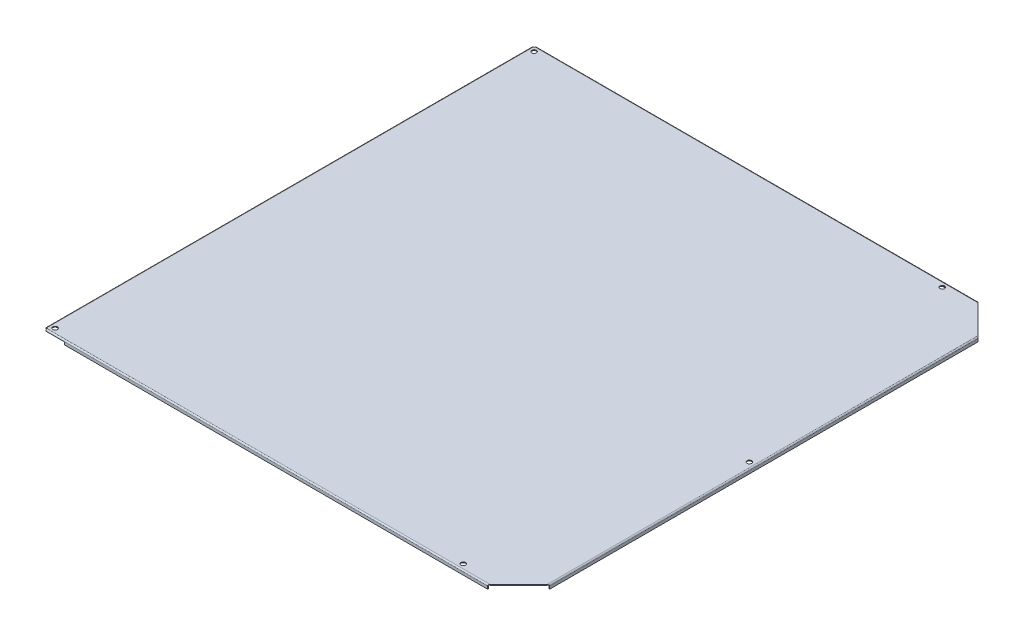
ISO-10303-21;
HEADER;
FILE_DESCRIPTION(('STEP AP214'),'2;1');
FILE_NAME('part.step','',(''),(''),'','','');
FILE_SCHEMA(('AUTOMOTIVE_DESIGN { 1 0 10303 214 1 1 1 1 }'));
ENDSEC;
DATA;
#1=APPLICATION_CONTEXT('core data for automotive mechanical design processes');
#2=APPLICATION_PROTOCOL_DEFINITION('international standard','automotive_design',2000,#1);
#3=PRODUCT_CONTEXT('',#1,'mechanical');
#4=PRODUCT('Part','Part','',(#3));
#5=PRODUCT_RELATED_PRODUCT_CATEGORY('part','',(#4));
#6=PRODUCT_DEFINITION_FORMATION('','',#4);
#7=PRODUCT_DEFINITION_CONTEXT('part definition',#1,'design');
#8=PRODUCT_DEFINITION('design','',#6,#7);
#9=PRODUCT_DEFINITION_SHAPE('','',#8);
#10=(LENGTH_UNIT() NAMED_UNIT(*) SI_UNIT(.MILLI.,.METRE.));
#11=(NAMED_UNIT(*) PLANE_ANGLE_UNIT() SI_UNIT($,.RADIAN.));
#12=(NAMED_UNIT(*) SI_UNIT($,.STERADIAN.) SOLID_ANGLE_UNIT());
#13=UNCERTAINTY_MEASURE_WITH_UNIT(LENGTH_MEASURE(1.E-05),#10,'distance_accuracy_value','');
#14=(GEOMETRIC_REPRESENTATION_CONTEXT(3) GLOBAL_UNCERTAINTY_ASSIGNED_CONTEXT((#13)) GLOBAL_UNIT_ASSIGNED_CONTEXT((#10,
#11,#12)) REPRESENTATION_CONTEXT('',''));
#15=CARTESIAN_POINT('',(0.,0.,0.));
#16=DIRECTION('',(0.,0.,1.));
#17=DIRECTION('',(1.,0.,0.));
#18=AXIS2_PLACEMENT_3D('',#15,#16,#17);
#19=CARTESIAN_POINT('',(457.5,8.,-474.));
#20=DIRECTION('',(-1.,0.,0.));
#21=DIRECTION('',(0.,0.,1.));
#22=AXIS2_PLACEMENT_3D('',#19,#20,#21);
#23=PLANE('',#22);
#24=DIRECTION('',(0.,0.,-1.));
#25=VECTOR('',#24,1.);
#26=CARTESIAN_POINT('',(457.5,5.5,-474.));
#27=LINE('',#26,#25);
#28=CARTESIAN_POINT('',(457.5,5.5,414.));
#29=VERTEX_POINT('',#28);
#30=CARTESIAN_POINT('',(457.5,5.50000000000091,-414.));
#31=VERTEX_POINT('',#30);
#32=EDGE_CURVE('E276',#29,#31,#27,.T.);
#33=ORIENTED_EDGE('',*,*,#32,.T.);
#34=DIRECTION('',(0.,1.,0.));
#35=VECTOR('',#34,1.);
#36=CARTESIAN_POINT('',(457.5,0.,-414.));
#37=LINE('',#36,#35);
#38=CARTESIAN_POINT('',(457.5,0.,-414.));
#39=VERTEX_POINT('',#38);
#40=EDGE_CURVE('E674',#31,#39,#37,.F.);
#41=ORIENTED_EDGE('',*,*,#40,.T.);
#42=DIRECTION('',(0.,0.,1.));
#43=VECTOR('',#42,1.);
#44=CARTESIAN_POINT('',(457.5,0.,-474.));
#45=LINE('',#44,#43);
#46=CARTESIAN_POINT('',(457.5,0.,414.));
#47=VERTEX_POINT('',#46);
#48=EDGE_CURVE('E668',#39,#47,#45,.T.);
#49=ORIENTED_EDGE('',*,*,#48,.T.);
#50=DIRECTION('',(0.,1.,0.));
#51=VECTOR('',#50,1.);
#52=CARTESIAN_POINT('',(457.5,0.,414.));
#53=LINE('',#52,#51);
#54=EDGE_CURVE('E848',#29,#47,#53,.F.);
#55=ORIENTED_EDGE('',*,*,#54,.F.);
#56=EDGE_LOOP('',(#33,#41,#49,#55));
#57=FACE_BOUND('',#56,.T.);
#58=ADVANCED_FACE('F17',(#57),#23,.T.);
#59=CARTESIAN_POINT('',(-459.,8.,472.5));
#60=DIRECTION('',(0.,0.,-1.));
#61=DIRECTION('',(-1.,0.,0.));
#62=AXIS2_PLACEMENT_3D('',#59,#60,#61);
#63=PLANE('',#62);
#64=DIRECTION('',(1.,0.,0.));
#65=VECTOR('',#64,1.);
#66=CARTESIAN_POINT('',(-459.,5.,472.5));
#67=LINE('',#66,#65);
#68=CARTESIAN_POINT('',(-454.585786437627,5.,472.5));
#69=VERTEX_POINT('',#68);
#70=CARTESIAN_POINT('',(-419.,5.,472.5));
#71=VERTEX_POINT('',#70);
#72=EDGE_CURVE('E280',#69,#71,#67,.T.);
#73=ORIENTED_EDGE('',*,*,#72,.F.);
#74=DIRECTION('',(0.,1.,0.));
#75=VECTOR('',#74,1.);
#76=CARTESIAN_POINT('',(-454.585786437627,6.5,472.5));
#77=LINE('',#76,#75);
#78=CARTESIAN_POINT('',(-454.585786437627,5.5,472.5));
#79=VERTEX_POINT('',#78);
#80=EDGE_CURVE('E273',#79,#69,#77,.F.);
#81=ORIENTED_EDGE('',*,*,#80,.F.);
#82=DIRECTION('',(1.,0.,0.));
#83=VECTOR('',#82,1.);
#84=CARTESIAN_POINT('',(-459.,5.5,472.5));
#85=LINE('',#84,#83);
#86=CARTESIAN_POINT('',(399.,5.50000000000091,472.5));
#87=VERTEX_POINT('',#86);
#88=EDGE_CURVE('E262',#79,#87,#85,.T.);
#89=ORIENTED_EDGE('',*,*,#88,.T.);
#90=DIRECTION('',(0.,1.,0.));
#91=VECTOR('',#90,1.);
#92=CARTESIAN_POINT('',(399.,0.,472.5));
#93=LINE('',#92,#91);
#94=CARTESIAN_POINT('',(399.,0.,472.5));
#95=VERTEX_POINT('',#94);
#96=EDGE_CURVE('E270',#87,#95,#93,.F.);
#97=ORIENTED_EDGE('',*,*,#96,.T.);
#98=DIRECTION('',(1.,0.,0.));
#99=VECTOR('',#98,1.);
#100=CARTESIAN_POINT('',(-459.,0.,472.5));
#101=LINE('',#100,#99);
#102=CARTESIAN_POINT('',(-419.,0.,472.5));
#103=VERTEX_POINT('',#102);
#104=EDGE_CURVE('E291',#95,#103,#101,.F.);
#105=ORIENTED_EDGE('',*,*,#104,.T.);
#106=DIRECTION('',(0.,1.,0.));
#107=VECTOR('',#106,1.);
#108=CARTESIAN_POINT('',(-419.,8.,472.5));
#109=LINE('',#108,#107);
#110=EDGE_CURVE('E293',#103,#71,#109,.T.);
#111=ORIENTED_EDGE('',*,*,#110,.T.);
#112=EDGE_LOOP('',(#73,#81,#89,#97,#105,#111));
#113=FACE_BOUND('',#112,.T.);
#114=ADVANCED_FACE('F269',(#113),#63,.T.);
#115=CARTESIAN_POINT('',(-459.,8.,-472.5));
#116=DIRECTION('',(0.,0.,1.));
#117=DIRECTION('',(1.,0.,0.));
#118=AXIS2_PLACEMENT_3D('',#115,#116,#117);
#119=PLANE('',#118);
#120=DIRECTION('',(1.,0.,0.));
#121=VECTOR('',#120,1.);
#122=CARTESIAN_POINT('',(-459.,5.,-472.5));
#123=LINE('',#122,#121);
#124=CARTESIAN_POINT('',(-454.585786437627,5.,-472.5));
#125=VERTEX_POINT('',#124);
#126=CARTESIAN_POINT('',(-419.,5.,-472.5));
#127=VERTEX_POINT('',#126);
#128=EDGE_CURVE('E275',#125,#127,#123,.T.);
#129=ORIENTED_EDGE('',*,*,#128,.T.);
#130=DIRECTION('',(0.,1.,0.));
#131=VECTOR('',#130,1.);
#132=CARTESIAN_POINT('',(-419.,8.,-472.5));
#133=LINE('',#132,#131);
#134=CARTESIAN_POINT('',(-419.,0.,-472.5));
#135=VERTEX_POINT('',#134);
#136=EDGE_CURVE('E655',#127,#135,#133,.F.);
#137=ORIENTED_EDGE('',*,*,#136,.T.);
#138=DIRECTION('',(1.,0.,0.));
#139=VECTOR('',#138,1.);
#140=CARTESIAN_POINT('',(-459.,0.,-472.5));
#141=LINE('',#140,#139);
#142=CARTESIAN_POINT('',(399.,0.,-472.5));
#143=VERTEX_POINT('',#142);
#144=EDGE_CURVE('E658',#135,#143,#141,.T.);
#145=ORIENTED_EDGE('',*,*,#144,.T.);
#146=DIRECTION('',(0.,1.,0.));
#147=VECTOR('',#146,1.);
#148=CARTESIAN_POINT('',(399.,0.,-472.5));
#149=LINE('',#148,#147);
#150=CARTESIAN_POINT('',(399.,5.5,-472.5));
#151=VERTEX_POINT('',#150);
#152=EDGE_CURVE('E790',#151,#143,#149,.F.);
#153=ORIENTED_EDGE('',*,*,#152,.F.);
#154=DIRECTION('',(-1.,0.,0.));
#155=VECTOR('',#154,1.);
#156=CARTESIAN_POINT('',(-459.,5.5,-472.5));
#157=LINE('',#156,#155);
#158=CARTESIAN_POINT('',(-454.585786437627,5.5,-472.5));
#159=VERTEX_POINT('',#158);
#160=EDGE_CURVE('E778',#151,#159,#157,.T.);
#161=ORIENTED_EDGE('',*,*,#160,.T.);
#162=DIRECTION('',(0.,1.,0.));
#163=VECTOR('',#162,1.);
#164=CARTESIAN_POINT('',(-454.585786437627,5.,-472.5));
#165=LINE('',#164,#163);
#166=EDGE_CURVE('E782',#125,#159,#165,.T.);
#167=ORIENTED_EDGE('',*,*,#166,.F.);
#168=EDGE_LOOP('',(#129,#137,#145,#153,#161,#167));
#169=FACE_BOUND('',#168,.T.);
#170=ADVANCED_FACE('F1058',(#169),#119,.T.);
#171=CARTESIAN_POINT('',(-457.5,8.,-474.));
#172=DIRECTION('',(1.,0.,0.));
#173=DIRECTION('',(0.,0.,-1.));
#174=AXIS2_PLACEMENT_3D('',#171,#172,#173);
#175=PLANE('',#174);
#176=DIRECTION('',(0.,1.,0.));
#177=VECTOR('',#176,1.);
#178=CARTESIAN_POINT('',(-457.5,8.,-434.));
#179=LINE('',#178,#177);
#180=CARTESIAN_POINT('',(-457.5,0.,-434.));
#181=VERTEX_POINT('',#180);
#182=CARTESIAN_POINT('',(-457.5,5.,-434.));
#183=VERTEX_POINT('',#182);
#184=EDGE_CURVE('E759',#181,#183,#179,.T.);
#185=ORIENTED_EDGE('',*,*,#184,.T.);
#186=DIRECTION('',(0.,0.,1.));
#187=VECTOR('',#186,1.);
#188=CARTESIAN_POINT('',(-457.5,5.,-474.));
#189=LINE('',#188,#187);
#190=CARTESIAN_POINT('',(-457.5,5.,-469.585786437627));
#191=VERTEX_POINT('',#190);
#192=EDGE_CURVE('E636',#183,#191,#189,.F.);
#193=ORIENTED_EDGE('',*,*,#192,.T.);
#194=DIRECTION('',(0.,1.,0.));
#195=VECTOR('',#194,1.);
#196=CARTESIAN_POINT('',(-457.5,6.5,-469.585786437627));
#197=LINE('',#196,#195);
#198=CARTESIAN_POINT('',(-457.5,5.5,-469.585786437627));
#199=VERTEX_POINT('',#198);
#200=EDGE_CURVE('E629',#199,#191,#197,.F.);
#201=ORIENTED_EDGE('',*,*,#200,.F.);
#202=DIRECTION('',(0.,0.,1.));
#203=VECTOR('',#202,1.);
#204=CARTESIAN_POINT('',(-457.5,5.5,-474.));
#205=LINE('',#204,#203);
#206=CARTESIAN_POINT('',(-457.5,5.5,469.585786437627));
#207=VERTEX_POINT('',#206);
#208=EDGE_CURVE('E698',#199,#207,#205,.T.);
#209=ORIENTED_EDGE('',*,*,#208,.T.);
#210=DIRECTION('',(0.,1.,0.));
#211=VECTOR('',#210,1.);
#212=CARTESIAN_POINT('',(-457.5,5.,469.585786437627));
#213=LINE('',#212,#211);
#214=CARTESIAN_POINT('',(-457.5,5.,469.585786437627));
#215=VERTEX_POINT('',#214);
#216=EDGE_CURVE('E749',#215,#207,#213,.T.);
#217=ORIENTED_EDGE('',*,*,#216,.F.);
#218=DIRECTION('',(0.,0.,-1.));
#219=VECTOR('',#218,1.);
#220=CARTESIAN_POINT('',(-457.5,5.,-474.));
#221=LINE('',#220,#219);
#222=CARTESIAN_POINT('',(-457.5,5.,434.));
#223=VERTEX_POINT('',#222);
#224=EDGE_CURVE('E615',#223,#215,#221,.F.);
#225=ORIENTED_EDGE('',*,*,#224,.F.);
#226=DIRECTION('',(0.,1.,0.));
#227=VECTOR('',#226,1.);
#228=CARTESIAN_POINT('',(-457.5,8.,434.));
#229=LINE('',#228,#227);
#230=CARTESIAN_POINT('',(-457.5,0.,434.));
#231=VERTEX_POINT('',#230);
#232=EDGE_CURVE('E621',#223,#231,#229,.F.);
#233=ORIENTED_EDGE('',*,*,#232,.T.);
#234=DIRECTION('',(0.,0.,1.));
#235=VECTOR('',#234,1.);
#236=CARTESIAN_POINT('',(-457.5,0.,-474.));
#237=LINE('',#236,#235);
#238=EDGE_CURVE('E620',#231,#181,#237,.F.);
#239=ORIENTED_EDGE('',*,*,#238,.T.);
#240=EDGE_LOOP('',(#185,#193,#201,#209,#217,#225,#233,#239));
#241=FACE_BOUND('',#240,.T.);
#242=ADVANCED_FACE('F1055',(#241),#175,.T.);
#243=CARTESIAN_POINT('',(-459.,0.,472.5));
#244=DIRECTION('',(0.,1.,0.));
#245=DIRECTION('',(0.,0.,1.));
#246=AXIS2_PLACEMENT_3D('',#243,#244,#245);
#247=PLANE('',#246);
#248=DIRECTION('',(0.,0.,1.));
#249=VECTOR('',#248,1.);
#250=CARTESIAN_POINT('',(399.,0.,474.));
#251=LINE('',#250,#249);
#252=CARTESIAN_POINT('',(399.,0.,474.));
#253=VERTEX_POINT('',#252);
#254=EDGE_CURVE('E255',#95,#253,#251,.T.);
#255=ORIENTED_EDGE('',*,*,#254,.T.);
#256=DIRECTION('',(-1.,0.,0.));
#257=VECTOR('',#256,1.);
#258=CARTESIAN_POINT('',(-459.,0.,474.));
#259=LINE('',#258,#257);
#260=CARTESIAN_POINT('',(-419.,0.,474.));
#261=VERTEX_POINT('',#260);
#262=EDGE_CURVE('E695',#253,#261,#259,.T.);
#263=ORIENTED_EDGE('',*,*,#262,.T.);
#264=DIRECTION('',(0.,0.,-1.));
#265=VECTOR('',#264,1.);
#266=CARTESIAN_POINT('',(-419.,0.,472.5));
#267=LINE('',#266,#265);
#268=EDGE_CURVE('E297',#261,#103,#267,.T.);
#269=ORIENTED_EDGE('',*,*,#268,.T.);
#270=ORIENTED_EDGE('',*,*,#104,.F.);
#271=EDGE_LOOP('',(#255,#263,#269,#270));
#272=FACE_BOUND('',#271,.T.);
#273=ADVANCED_FACE('F723',(#272),#247,.F.);
#274=CARTESIAN_POINT('',(-419.,8.,472.5));
#275=DIRECTION('',(1.,0.,0.));
#276=DIRECTION('',(0.,0.,-1.));
#277=AXIS2_PLACEMENT_3D('',#274,#275,#276);
#278=PLANE('',#277);
#279=DIRECTION('',(0.,1.,0.));
#280=VECTOR('',#279,1.);
#281=CARTESIAN_POINT('',(-419.,8.,474.));
#282=LINE('',#281,#280);
#283=CARTESIAN_POINT('',(-419.,5.,474.));
#284=VERTEX_POINT('',#283);
#285=EDGE_CURVE('E697',#261,#284,#282,.T.);
#286=ORIENTED_EDGE('',*,*,#285,.T.);
#287=DIRECTION('',(0.,0.,-1.));
#288=VECTOR('',#287,1.);
#289=CARTESIAN_POINT('',(-419.,5.,472.5));
#290=LINE('',#289,#288);
#291=EDGE_CURVE('E284',#71,#284,#290,.F.);
#292=ORIENTED_EDGE('',*,*,#291,.F.);
#293=ORIENTED_EDGE('',*,*,#110,.F.);
#294=ORIENTED_EDGE('',*,*,#268,.F.);
#295=EDGE_LOOP('',(#286,#292,#293,#294));
#296=FACE_BOUND('',#295,.T.);
#297=ADVANCED_FACE('F728',(#296),#278,.F.);
#298=CARTESIAN_POINT('',(-459.,5.,472.5));
#299=DIRECTION('',(0.,-1.,0.));
#300=DIRECTION('',(0.,0.,-1.));
#301=AXIS2_PLACEMENT_3D('',#298,#299,#300);
#302=PLANE('',#301);
#303=DIRECTION('',(0.,0.,1.));
#304=VECTOR('',#303,1.);
#305=CARTESIAN_POINT('',(-454.585786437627,5.,472.5));
#306=LINE('',#305,#304);
#307=CARTESIAN_POINT('',(-454.585786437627,5.,474.));
#308=VERTEX_POINT('',#307);
#309=EDGE_CURVE('E254',#69,#308,#306,.T.);
#310=ORIENTED_EDGE('',*,*,#309,.F.);
#311=ORIENTED_EDGE('',*,*,#72,.T.);
#312=ORIENTED_EDGE('',*,*,#291,.T.);
#313=DIRECTION('',(-1.,0.,0.));
#314=VECTOR('',#313,1.);
#315=CARTESIAN_POINT('',(-459.,5.,474.));
#316=LINE('',#315,#314);
#317=EDGE_CURVE('E703',#284,#308,#316,.T.);
#318=ORIENTED_EDGE('',*,*,#317,.T.);
#319=EDGE_LOOP('',(#310,#311,#312,#318));
#320=FACE_BOUND('',#319,.T.);
#321=ADVANCED_FACE('F731',(#320),#302,.T.);
#322=CARTESIAN_POINT('',(399.,0.,474.));
#323=DIRECTION('',(-1.,0.,0.));
#324=DIRECTION('',(0.,0.,1.));
#325=AXIS2_PLACEMENT_3D('',#322,#323,#324);
#326=PLANE('',#325);
#327=DIRECTION('',(0.,1.,0.));
#328=VECTOR('',#327,1.);
#329=CARTESIAN_POINT('',(399.,8.,474.));
#330=LINE('',#329,#328);
#331=CARTESIAN_POINT('',(399.,5.5,474.));
#332=VERTEX_POINT('',#331);
#333=EDGE_CURVE('E267',#332,#253,#330,.F.);
#334=ORIENTED_EDGE('',*,*,#333,.T.);
#335=ORIENTED_EDGE('',*,*,#254,.F.);
#336=ORIENTED_EDGE('',*,*,#96,.F.);
#337=DIRECTION('',(0.,0.,1.));
#338=VECTOR('',#337,1.);
#339=CARTESIAN_POINT('',(399.,5.5,474.));
#340=LINE('',#339,#338);
#341=EDGE_CURVE('E244',#332,#87,#340,.F.);
#342=ORIENTED_EDGE('',*,*,#341,.F.);
#343=EDGE_LOOP('',(#334,#335,#336,#342));
#344=FACE_BOUND('',#343,.T.);
#345=ADVANCED_FACE('F279',(#344),#326,.F.);
#346=CARTESIAN_POINT('',(-454.585786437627,6.5,472.5));
#347=DIRECTION('',(-1.,0.,0.));
#348=DIRECTION('',(0.,0.,1.));
#349=AXIS2_PLACEMENT_3D('',#346,#347,#348);
#350=PLANE('',#349);
#351=DIRECTION('',(0.,0.,1.));
#352=VECTOR('',#351,1.);
#353=CARTESIAN_POINT('',(-454.585786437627,5.5,473.25));
#354=LINE('',#353,#352);
#355=CARTESIAN_POINT('',(-454.585786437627,5.5,474.));
#356=VERTEX_POINT('',#355);
#357=EDGE_CURVE('E895',#79,#356,#354,.T.);
#358=ORIENTED_EDGE('',*,*,#357,.F.);
#359=ORIENTED_EDGE('',*,*,#80,.T.);
#360=ORIENTED_EDGE('',*,*,#309,.T.);
#361=DIRECTION('',(0.,1.,0.));
#362=VECTOR('',#361,1.);
#363=CARTESIAN_POINT('',(-454.585786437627,8.,474.));
#364=LINE('',#363,#362);
#365=EDGE_CURVE('E705',#308,#356,#364,.T.);
#366=ORIENTED_EDGE('',*,*,#365,.T.);
#367=EDGE_LOOP('',(#358,#359,#360,#366));
#368=FACE_BOUND('',#367,.T.);
#369=ADVANCED_FACE('F734',(#368),#350,.T.);
#370=CARTESIAN_POINT('',(459.,0.,-414.));
#371=DIRECTION('',(0.,0.,1.));
#372=DIRECTION('',(1.,0.,0.));
#373=AXIS2_PLACEMENT_3D('',#370,#371,#372);
#374=PLANE('',#373);
#375=DIRECTION('',(0.,1.,0.));
#376=VECTOR('',#375,1.);
#377=CARTESIAN_POINT('',(459.,8.,-414.));
#378=LINE('',#377,#376);
#379=CARTESIAN_POINT('',(459.,5.5,-414.));
#380=VERTEX_POINT('',#379);
#381=CARTESIAN_POINT('',(459.,0.,-414.));
#382=VERTEX_POINT('',#381);
#383=EDGE_CURVE('E856',#380,#382,#378,.F.);
#384=ORIENTED_EDGE('',*,*,#383,.T.);
#385=DIRECTION('',(1.,0.,0.));
#386=VECTOR('',#385,1.);
#387=CARTESIAN_POINT('',(457.5,0.,-414.));
#388=LINE('',#387,#386);
#389=EDGE_CURVE('E671',#382,#39,#388,.F.);
#390=ORIENTED_EDGE('',*,*,#389,.T.);
#391=ORIENTED_EDGE('',*,*,#40,.F.);
#392=DIRECTION('',(1.,0.,0.));
#393=VECTOR('',#392,1.);
#394=CARTESIAN_POINT('',(459.,5.5,-414.));
#395=LINE('',#394,#393);
#396=EDGE_CURVE('E676',#380,#31,#395,.F.);
#397=ORIENTED_EDGE('',*,*,#396,.F.);
#398=EDGE_LOOP('',(#384,#390,#391,#397));
#399=FACE_BOUND('',#398,.T.);
#400=ADVANCED_FACE('F1030',(#399),#374,.F.);
#401=CARTESIAN_POINT('',(457.5,0.,-474.));
#402=DIRECTION('',(0.,1.,0.));
#403=DIRECTION('',(0.,0.,1.));
#404=AXIS2_PLACEMENT_3D('',#401,#402,#403);
#405=PLANE('',#404);
#406=DIRECTION('',(1.,0.,0.));
#407=VECTOR('',#406,1.);
#408=CARTESIAN_POINT('',(459.,0.,414.));
#409=LINE('',#408,#407);
#410=CARTESIAN_POINT('',(459.,0.,414.));
#411=VERTEX_POINT('',#410);
#412=EDGE_CURVE('E670',#47,#411,#409,.T.);
#413=ORIENTED_EDGE('',*,*,#412,.F.);
#414=ORIENTED_EDGE('',*,*,#48,.F.);
#415=ORIENTED_EDGE('',*,*,#389,.F.);
#416=DIRECTION('',(0.,0.,1.));
#417=VECTOR('',#416,1.);
#418=CARTESIAN_POINT('',(459.,0.,-474.));
#419=LINE('',#418,#417);
#420=EDGE_CURVE('E853',#382,#411,#419,.T.);
#421=ORIENTED_EDGE('',*,*,#420,.T.);
#422=EDGE_LOOP('',(#413,#414,#415,#421));
#423=FACE_BOUND('',#422,.T.);
#424=ADVANCED_FACE('F1036',(#423),#405,.F.);
#425=CARTESIAN_POINT('',(459.,0.,414.));
#426=DIRECTION('',(0.,0.,1.));
#427=DIRECTION('',(1.,0.,0.));
#428=AXIS2_PLACEMENT_3D('',#425,#426,#427);
#429=PLANE('',#428);
#430=DIRECTION('',(1.,0.,-1.11022302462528E-13));
#431=VECTOR('',#430,1.);
#432=CARTESIAN_POINT('',(458.25,5.5,414.));
#433=LINE('',#432,#431);
#434=CARTESIAN_POINT('',(459.,5.5,414.));
#435=VERTEX_POINT('',#434);
#436=EDGE_CURVE('E868',#29,#435,#433,.T.);
#437=ORIENTED_EDGE('',*,*,#436,.F.);
#438=ORIENTED_EDGE('',*,*,#54,.T.);
#439=ORIENTED_EDGE('',*,*,#412,.T.);
#440=DIRECTION('',(0.,1.,0.));
#441=VECTOR('',#440,1.);
#442=CARTESIAN_POINT('',(459.,8.,414.));
#443=LINE('',#442,#441);
#444=EDGE_CURVE('E855',#411,#435,#443,.T.);
#445=ORIENTED_EDGE('',*,*,#444,.T.);
#446=EDGE_LOOP('',(#437,#438,#439,#445));
#447=FACE_BOUND('',#446,.T.);
#448=ADVANCED_FACE('F864',(#447),#429,.T.);
#449=CARTESIAN_POINT('',(456.5,5.5,-474.));
#450=DIRECTION('',(0.,0.,-1.));
#451=DIRECTION('',(-1.,0.,0.));
#452=AXIS2_PLACEMENT_3D('',#449,#450,#451);
#453=CYLINDRICAL_SURFACE('',#452,1.);
#454=DIRECTION('',(0.,0.,1.));
#455=VECTOR('',#454,1.);
#456=CARTESIAN_POINT('',(456.5,6.5,0.));
#457=LINE('',#456,#455);
#458=CARTESIAN_POINT('',(456.5,6.5,416.5));
#459=VERTEX_POINT('',#458);
#460=CARTESIAN_POINT('',(456.5,6.5,-416.5));
#461=VERTEX_POINT('',#460);
#462=EDGE_CURVE('E878',#459,#461,#457,.F.);
#463=ORIENTED_EDGE('',*,*,#462,.T.);
#464=CARTESIAN_POINT('',(457.5,5.50000000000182,-414.));
#465=CARTESIAN_POINT('',(457.500001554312,5.51180446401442,-413.999996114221));
#466=CARTESIAN_POINT('',(457.499790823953,5.52360180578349,-414.000522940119));
#467=CARTESIAN_POINT('',(457.49895994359,5.54707613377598,-414.002600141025));
#468=CARTESIAN_POINT('',(457.498340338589,5.55875325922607,-414.004149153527));
#469=CARTESIAN_POINT('',(457.495912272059,5.59317710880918,-414.010219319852));
#470=CARTESIAN_POINT('',(457.493533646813,5.61564249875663,-414.016165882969));
#471=CARTESIAN_POINT('',(457.486730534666,5.6646877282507,-414.033173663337));
#472=CARTESIAN_POINT('',(457.481943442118,5.69089371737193,-414.045141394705));
#473=CARTESIAN_POINT('',(457.470865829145,5.74100440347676,-414.072835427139));
#474=CARTESIAN_POINT('',(457.464567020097,5.76489535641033,-414.088582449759));
#475=CARTESIAN_POINT('',(457.446302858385,5.82573110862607,-414.134242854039));
#476=CARTESIAN_POINT('',(457.433386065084,5.86057773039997,-414.16653483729));
#477=CARTESIAN_POINT('',(457.405880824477,5.92497768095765,-414.235297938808));
#478=CARTESIAN_POINT('',(457.391288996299,5.95451998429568,-414.271777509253));
#479=CARTESIAN_POINT('',(457.359880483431,6.01161212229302,-414.350298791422));
#480=CARTESIAN_POINT('',(457.342979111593,6.03881945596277,-414.392552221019));
#481=CARTESIAN_POINT('',(457.308399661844,6.08943057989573,-414.479000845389));
#482=CARTESIAN_POINT('',(457.290720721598,6.11283000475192,-414.523198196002));
#483=CARTESIAN_POINT('',(457.254798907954,6.15656712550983,-414.613002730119));
#484=CARTESIAN_POINT('',(457.236554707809,6.17689683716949,-414.658613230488));
#485=CARTESIAN_POINT('',(457.199704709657,6.21492171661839,-414.750738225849));
#486=CARTESIAN_POINT('',(457.181099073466,6.23261803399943,-414.797252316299));
#487=CARTESIAN_POINT('',(457.139686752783,6.26923168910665,-414.900783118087));
#488=CARTESIAN_POINT('',(457.116816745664,6.28762780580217,-414.957958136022));
#489=CARTESIAN_POINT('',(457.070787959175,6.32159407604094,-415.073030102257));
#490=CARTESIAN_POINT('',(457.047629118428,6.33716361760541,-415.130927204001));
#491=CARTESIAN_POINT('',(456.977792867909,6.38018059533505,-415.305517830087));
#492=CARTESIAN_POINT('',(456.930796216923,6.40390219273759,-415.42300945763));
#493=CARTESIAN_POINT('',(456.836379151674,6.44310673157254,-415.659052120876));
#494=CARTESIAN_POINT('',(456.788958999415,6.45859445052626,-415.777602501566));
#495=CARTESIAN_POINT('',(456.693865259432,6.48225091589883,-416.015336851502));
#496=CARTESIAN_POINT('',(456.64619166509,6.49041947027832,-416.134520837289));
#497=CARTESIAN_POINT('',(456.582057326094,6.49676353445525,-416.29485668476));
#498=CARTESIAN_POINT('',(456.565631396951,6.49797937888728,-416.33592150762));
#499=CARTESIAN_POINT('',(456.532803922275,6.49959677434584,-416.417990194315));
#500=CARTESIAN_POINT('',(456.5164023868,6.49999980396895,-416.458994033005));
#501=CARTESIAN_POINT('',(456.5,6.5,-416.5));
#502=B_SPLINE_CURVE_WITH_KNOTS('',3,(#464,#465,#466,#467,#468,#469,#470,#471,#472,#473,#474,
#475,#476,#477,#478,#479,#480,#481,#482,#483,#484,#485,#486,#487,#488,#489,#490,#491,#492,#493,
#494,#495,#496,#497,#498,#499,#500,#501),.UNSPECIFIED.,.F.,.F.,(4,2,2,2,2,2,2,2,2,2,2,2,2,2,2,2,
2,2,4),(0.,0.0353868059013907,0.0707265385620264,0.140442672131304,0.22757192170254,
0.315190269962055,0.462061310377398,0.609234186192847,0.768049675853,0.927045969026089,
1.0864489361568,1.24578211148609,1.43850404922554,1.63126766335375,2.01713658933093,
2.40278137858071,2.78843628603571,2.92116582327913,3.0536536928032),.UNSPECIFIED.);
#503=EDGE_CURVE('E407',#31,#461,#502,.T.);
#504=ORIENTED_EDGE('',*,*,#503,.F.);
#505=ORIENTED_EDGE('',*,*,#32,.F.);
#506=CARTESIAN_POINT('',(456.5,6.5,416.5));
#507=CARTESIAN_POINT('',(456.536876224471,6.49997629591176,416.407809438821));
#508=CARTESIAN_POINT('',(456.57375509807,6.49795873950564,416.315612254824));
#509=CARTESIAN_POINT('',(456.647636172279,6.48975001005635,416.130909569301));
#510=CARTESIAN_POINT('',(456.68463804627,6.483537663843,416.038404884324));
#511=CARTESIAN_POINT('',(456.758582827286,6.46673289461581,415.853542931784));
#512=CARTESIAN_POINT('',(456.795525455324,6.45613146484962,415.761186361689));
#513=CARTESIAN_POINT('',(456.869265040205,6.43014889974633,415.576837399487));
#514=CARTESIAN_POINT('',(456.906061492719,6.41475722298,415.484846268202));
#515=CARTESIAN_POINT('',(456.979235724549,6.37863309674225,415.301910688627));
#516=CARTESIAN_POINT('',(457.015614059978,6.35790888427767,415.210964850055));
#517=CARTESIAN_POINT('',(457.087761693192,6.31019241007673,415.030595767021));
#518=CARTESIAN_POINT('',(457.123531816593,6.28320952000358,414.941170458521));
#519=CARTESIAN_POINT('',(457.170170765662,6.24235847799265,414.824573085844));
#520=CARTESIAN_POINT('',(457.181468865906,6.23201292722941,414.79632783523));
#521=CARTESIAN_POINT('',(457.203946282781,6.21042419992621,414.740134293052));
#522=CARTESIAN_POINT('',(457.215125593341,6.19918097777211,414.712186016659));
#523=CARTESIAN_POINT('',(457.248513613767,6.16391445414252,414.628715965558));
#524=CARTESIAN_POINT('',(457.270513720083,6.1384046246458,414.573715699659));
#525=CARTESIAN_POINT('',(457.304351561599,6.09449204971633,414.489121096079));
#526=CARTESIAN_POINT('',(457.31648837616,6.07775497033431,414.458779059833));
#527=CARTESIAN_POINT('',(457.340380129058,6.04241767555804,414.399049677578));
#528=CARTESIAN_POINT('',(457.352135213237,6.02381818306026,414.369661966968));
#529=CARTESIAN_POINT('',(457.375088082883,5.98449709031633,414.312279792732));
#530=CARTESIAN_POINT('',(457.386287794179,5.96378371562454,414.284280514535));
#531=CARTESIAN_POINT('',(457.407957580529,5.91977926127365,414.230106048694));
#532=CARTESIAN_POINT('',(457.418428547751,5.89649142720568,414.203928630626));
#533=CARTESIAN_POINT('',(457.436511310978,5.85131998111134,414.158721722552));
#534=CARTESIAN_POINT('',(457.444297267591,5.82994747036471,414.139256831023));
#535=CARTESIAN_POINT('',(457.458882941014,5.78479238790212,414.102792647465));
#536=CARTESIAN_POINT('',(457.465681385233,5.76100677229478,414.085796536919));
#537=CARTESIAN_POINT('',(457.477953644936,5.71046227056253,414.055115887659));
#538=CARTESIAN_POINT('',(457.483404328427,5.68366161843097,414.041489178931));
#539=CARTESIAN_POINT('',(457.492208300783,5.62771414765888,414.019479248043));
#540=CARTESIAN_POINT('',(457.495573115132,5.59858124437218,414.01106721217));
#541=CARTESIAN_POINT('',(457.498411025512,5.55750119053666,414.00397243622));
#542=CARTESIAN_POINT('',(457.499003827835,5.5460787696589,414.002490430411));
#543=CARTESIAN_POINT('',(457.49979913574,5.52310730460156,414.000502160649));
#544=CARTESIAN_POINT('',(457.500000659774,5.51155801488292,413.999998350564));
#545=CARTESIAN_POINT('',(457.5,5.5,414.));
#546=B_SPLINE_CURVE_WITH_KNOTS('',3,(#506,#507,#508,#509,#510,#511,#512,#513,#514,#515,#516,
#517,#518,#519,#520,#521,#522,#523,#524,#525,#526,#527,#528,#529,#530,#531,#532,#533,#534,#535,
#536,#537,#538,#539,#540,#541,#542,#543,#544,#545),.UNSPECIFIED.,.F.,.F.,(4,2,2,2,2,2,2,2,2,2,2,
2,2,2,2,2,2,2,2,4),(0.,0.297868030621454,0.597250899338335,0.897251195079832,1.19791639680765,
1.49811992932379,1.79787681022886,1.89426080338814,1.99064969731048,2.18392431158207,
2.29402644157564,2.40408599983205,2.51373253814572,2.62324238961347,2.7128946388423,
2.80266141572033,2.89387595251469,2.98458188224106,3.01914027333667,3.05378524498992),.UNSPECIFIED.);
#547=EDGE_CURVE('E452',#459,#29,#546,.T.);
#548=ORIENTED_EDGE('',*,*,#547,.F.);
#549=EDGE_LOOP('',(#463,#504,#505,#548));
#550=FACE_BOUND('',#549,.T.);
#551=ADVANCED_FACE('F443',(#550),#453,.F.);
#552=CARTESIAN_POINT('',(-459.,5.5,471.5));
#553=DIRECTION('',(1.,0.,0.));
#554=DIRECTION('',(0.,0.,-1.));
#555=AXIS2_PLACEMENT_3D('',#552,#553,#554);
#556=CYLINDRICAL_SURFACE('',#555,1.);
#557=ORIENTED_EDGE('',*,*,#88,.F.);
#558=CARTESIAN_POINT('',(-455.,6.5,471.5));
#559=CARTESIAN_POINT('',(-454.999994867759,6.50000371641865,471.523969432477));
#560=CARTESIAN_POINT('',(-454.999013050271,6.49913797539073,471.547905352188));
#561=CARTESIAN_POINT('',(-454.995386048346,6.4957150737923,471.595486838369));
#562=CARTESIAN_POINT('',(-454.992744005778,6.4931611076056,471.619132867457));
#563=CARTESIAN_POINT('',(-454.982812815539,6.48309190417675,471.689028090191));
#564=CARTESIAN_POINT('',(-454.973508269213,6.4731675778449,471.734659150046));
#565=CARTESIAN_POINT('',(-454.951380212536,6.44754022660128,471.822908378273));
#566=CARTESIAN_POINT('',(-454.938582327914,6.43187900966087,471.865545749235));
#567=CARTESIAN_POINT('',(-454.910688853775,6.3952715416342,471.947793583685));
#568=CARTESIAN_POINT('',(-454.895587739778,6.37431250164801,471.987396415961));
#569=CARTESIAN_POINT('',(-454.860894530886,6.32291100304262,472.070673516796));
#570=CARTESIAN_POINT('',(-454.841008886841,6.291409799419,472.113573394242));
#571=CARTESIAN_POINT('',(-454.800668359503,6.22218818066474,472.193721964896));
#572=CARTESIAN_POINT('',(-454.780213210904,6.18446482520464,472.230967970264));
#573=CARTESIAN_POINT('',(-454.73740069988,6.09822600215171,472.303551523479));
#574=CARTESIAN_POINT('',(-454.715132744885,6.04894798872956,472.338042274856));
#575=CARTESIAN_POINT('',(-454.673389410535,5.94405307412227,472.398030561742));
#576=CARTESIAN_POINT('',(-454.653913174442,5.88843812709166,472.423530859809));
#577=CARTESIAN_POINT('',(-454.625370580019,5.7890883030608,472.458297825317));
#578=CARTESIAN_POINT('',(-454.614925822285,5.74664039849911,472.470131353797));
#579=CARTESIAN_POINT('',(-454.598190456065,5.65985582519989,472.488123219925));
#580=CARTESIAN_POINT('',(-454.591882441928,5.61552791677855,472.494305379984));
#581=CARTESIAN_POINT('',(-454.586750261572,5.54727972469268,472.499165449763));
#582=CARTESIAN_POINT('',(-454.585795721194,5.52364981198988,472.500011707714));
#583=CARTESIAN_POINT('',(-454.585786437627,5.5,472.5));
#584=B_SPLINE_CURVE_WITH_KNOTS('',3,(#558,#559,#560,#561,#562,#563,#564,#565,#566,#567,#568,
#569,#570,#571,#572,#573,#574,#575,#576,#577,#578,#579,#580,#581,#582,#583),.UNSPECIFIED.,.F.,
.F.,(4,2,2,2,2,2,2,2,2,2,2,2,4),(0.,0.0718194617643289,0.143503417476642,0.285617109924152,
0.426715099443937,0.568157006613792,0.737942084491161,0.907807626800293,1.09930104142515,
1.29073556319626,1.42614133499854,1.56097365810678,1.63186947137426),.UNSPECIFIED.);
#585=CARTESIAN_POINT('',(-455.,6.5,471.5));
#586=VERTEX_POINT('',#585);
#587=EDGE_CURVE('E447',#586,#79,#584,.T.);
#588=ORIENTED_EDGE('',*,*,#587,.F.);
#589=DIRECTION('',(1.,0.,0.));
#590=VECTOR('',#589,1.);
#591=CARTESIAN_POINT('',(0.,6.5,471.5));
#592=LINE('',#591,#590);
#593=CARTESIAN_POINT('',(401.5,6.5,471.5));
#594=VERTEX_POINT('',#593);
#595=EDGE_CURVE('E265',#586,#594,#592,.T.);
#596=ORIENTED_EDGE('',*,*,#595,.T.);
#597=CARTESIAN_POINT('',(399.000000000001,5.50000000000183,472.5));
#598=CARTESIAN_POINT('',(398.999996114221,5.51180446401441,472.500001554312));
#599=CARTESIAN_POINT('',(399.000522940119,5.52360180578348,472.499790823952));
#600=CARTESIAN_POINT('',(399.002600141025,5.54707613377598,472.49895994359));
#601=CARTESIAN_POINT('',(399.004149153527,5.55875325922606,472.498340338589));
#602=CARTESIAN_POINT('',(399.010219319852,5.59317710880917,472.495912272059));
#603=CARTESIAN_POINT('',(399.016165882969,5.61564249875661,472.493533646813));
#604=CARTESIAN_POINT('',(399.033173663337,5.66468772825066,472.486730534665));
#605=CARTESIAN_POINT('',(399.045141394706,5.69089371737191,472.481943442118));
#606=CARTESIAN_POINT('',(399.072835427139,5.74100440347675,472.470865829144));
#607=CARTESIAN_POINT('',(399.088582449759,5.76489535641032,472.464567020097));
#608=CARTESIAN_POINT('',(399.134242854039,5.82573110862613,472.446302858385));
#609=CARTESIAN_POINT('',(399.16653483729,5.86057773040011,472.433386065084));
#610=CARTESIAN_POINT('',(399.235297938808,5.9249776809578,472.405880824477));
#611=CARTESIAN_POINT('',(399.271777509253,5.95451998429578,472.391288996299));
#612=CARTESIAN_POINT('',(399.350298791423,6.01161212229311,472.359880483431));
#613=CARTESIAN_POINT('',(399.392552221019,6.03881945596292,472.342979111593));
#614=CARTESIAN_POINT('',(399.47900084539,6.08943057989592,472.308399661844));
#615=CARTESIAN_POINT('',(399.523198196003,6.1128300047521,472.290720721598));
#616=CARTESIAN_POINT('',(399.613002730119,6.15656712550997,472.254798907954));
#617=CARTESIAN_POINT('',(399.658613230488,6.17689683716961,472.236554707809));
#618=CARTESIAN_POINT('',(399.750738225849,6.21492171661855,472.199704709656));
#619=CARTESIAN_POINT('',(399.7972523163,6.23261803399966,472.181099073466));
#620=CARTESIAN_POINT('',(399.900783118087,6.26923168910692,472.139686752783));
#621=CARTESIAN_POINT('',(399.957958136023,6.2876278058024,472.116816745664));
#622=CARTESIAN_POINT('',(400.073030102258,6.32159407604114,472.070787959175));
#623=CARTESIAN_POINT('',(400.130927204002,6.33716361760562,472.047629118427));
#624=CARTESIAN_POINT('',(400.305517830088,6.38018059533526,471.977792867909));
#625=CARTESIAN_POINT('',(400.423009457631,6.40390219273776,471.930796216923));
#626=CARTESIAN_POINT('',(400.659052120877,6.44310673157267,471.836379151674));
#627=CARTESIAN_POINT('',(400.777602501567,6.45859445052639,471.788958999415));
#628=CARTESIAN_POINT('',(401.015336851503,6.48225091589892,471.693865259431));
#629=CARTESIAN_POINT('',(401.13452083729,6.49041947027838,471.646191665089));
#630=CARTESIAN_POINT('',(401.294856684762,6.49676353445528,471.582057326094));
#631=CARTESIAN_POINT('',(401.335921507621,6.49797937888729,471.565631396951));
#632=CARTESIAN_POINT('',(401.417990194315,6.49959677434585,471.532803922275));
#633=CARTESIAN_POINT('',(401.458994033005,6.49999980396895,471.5164023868));
#634=CARTESIAN_POINT('',(401.5,6.5,471.5));
#635=B_SPLINE_CURVE_WITH_KNOTS('',3,(#597,#598,#599,#600,#601,#602,#603,#604,#605,#606,#607,
#608,#609,#610,#611,#612,#613,#614,#615,#616,#617,#618,#619,#620,#621,#622,#623,#624,#625,#626,
#627,#628,#629,#630,#631,#632,#633,#634),.UNSPECIFIED.,.F.,.F.,(4,2,2,2,2,2,2,2,2,2,2,2,2,2,2,2,
2,2,4),(0.,0.0353868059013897,0.0707265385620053,0.140442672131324,0.227571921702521,
0.315190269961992,0.462061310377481,0.609234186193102,0.768049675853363,0.927045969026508,
1.08644893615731,1.2457821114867,1.43850404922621,1.6312676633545,2.01713658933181,
2.40278137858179,2.7884362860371,2.92116582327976,3.05365369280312),.UNSPECIFIED.);
#636=EDGE_CURVE('E24',#87,#594,#635,.T.);
#637=ORIENTED_EDGE('',*,*,#636,.F.);
#638=EDGE_LOOP('',(#557,#588,#596,#637));
#639=FACE_BOUND('',#638,.T.);
#640=ADVANCED_FACE('F261',(#639),#556,.F.);
#641=CARTESIAN_POINT('',(-459.,5.,-472.5));
#642=DIRECTION('',(0.,1.,0.));
#643=DIRECTION('',(0.,0.,1.));
#644=AXIS2_PLACEMENT_3D('',#641,#642,#643);
#645=PLANE('',#644);
#646=DIRECTION('',(1.,0.,0.));
#647=VECTOR('',#646,1.);
#648=CARTESIAN_POINT('',(-459.,5.,-474.));
#649=LINE('',#648,#647);
#650=CARTESIAN_POINT('',(-454.585786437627,5.,-474.));
#651=VERTEX_POINT('',#650);
#652=CARTESIAN_POINT('',(-419.,5.,-474.));
#653=VERTEX_POINT('',#652);
#654=EDGE_CURVE('E804',#651,#653,#649,.T.);
#655=ORIENTED_EDGE('',*,*,#654,.T.);
#656=DIRECTION('',(0.,0.,-1.));
#657=VECTOR('',#656,1.);
#658=CARTESIAN_POINT('',(-419.,5.,-472.5));
#659=LINE('',#658,#657);
#660=EDGE_CURVE('E665',#653,#127,#659,.F.);
#661=ORIENTED_EDGE('',*,*,#660,.T.);
#662=ORIENTED_EDGE('',*,*,#128,.F.);
#663=DIRECTION('',(0.,0.,1.));
#664=VECTOR('',#663,1.);
#665=CARTESIAN_POINT('',(-454.585786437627,5.,-472.5));
#666=LINE('',#665,#664);
#667=EDGE_CURVE('E785',#651,#125,#666,.T.);
#668=ORIENTED_EDGE('',*,*,#667,.F.);
#669=EDGE_LOOP('',(#655,#661,#662,#668));
#670=FACE_BOUND('',#669,.T.);
#671=ADVANCED_FACE('F437',(#670),#645,.F.);
#672=CARTESIAN_POINT('',(-419.,8.,-472.5));
#673=DIRECTION('',(1.,0.,0.));
#674=DIRECTION('',(0.,0.,-1.));
#675=AXIS2_PLACEMENT_3D('',#672,#673,#674);
#676=PLANE('',#675);
#677=DIRECTION('',(0.,1.,0.));
#678=VECTOR('',#677,1.);
#679=CARTESIAN_POINT('',(-419.,8.,-474.));
#680=LINE('',#679,#678);
#681=CARTESIAN_POINT('',(-419.,0.,-474.));
#682=VERTEX_POINT('',#681);
#683=EDGE_CURVE('E796',#653,#682,#680,.F.);
#684=ORIENTED_EDGE('',*,*,#683,.T.);
#685=DIRECTION('',(0.,0.,1.));
#686=VECTOR('',#685,1.);
#687=CARTESIAN_POINT('',(-419.,0.,-472.5));
#688=LINE('',#687,#686);
#689=EDGE_CURVE('E661',#682,#135,#688,.T.);
#690=ORIENTED_EDGE('',*,*,#689,.T.);
#691=ORIENTED_EDGE('',*,*,#136,.F.);
#692=ORIENTED_EDGE('',*,*,#660,.F.);
#693=EDGE_LOOP('',(#684,#690,#691,#692));
#694=FACE_BOUND('',#693,.T.);
#695=ADVANCED_FACE('F433',(#694),#676,.F.);
#696=CARTESIAN_POINT('',(-459.,0.,-472.5));
#697=DIRECTION('',(0.,1.,0.));
#698=DIRECTION('',(0.,0.,1.));
#699=AXIS2_PLACEMENT_3D('',#696,#697,#698);
#700=PLANE('',#699);
#701=DIRECTION('',(0.,0.,-1.));
#702=VECTOR('',#701,1.);
#703=CARTESIAN_POINT('',(399.,0.,-474.));
#704=LINE('',#703,#702);
#705=CARTESIAN_POINT('',(399.,0.,-474.));
#706=VERTEX_POINT('',#705);
#707=EDGE_CURVE('E660',#143,#706,#704,.T.);
#708=ORIENTED_EDGE('',*,*,#707,.F.);
#709=ORIENTED_EDGE('',*,*,#144,.F.);
#710=ORIENTED_EDGE('',*,*,#689,.F.);
#711=DIRECTION('',(1.,0.,0.));
#712=VECTOR('',#711,1.);
#713=CARTESIAN_POINT('',(-459.,0.,-474.));
#714=LINE('',#713,#712);
#715=EDGE_CURVE('E793',#682,#706,#714,.T.);
#716=ORIENTED_EDGE('',*,*,#715,.T.);
#717=EDGE_LOOP('',(#708,#709,#710,#716));
#718=FACE_BOUND('',#717,.T.);
#719=ADVANCED_FACE('F429',(#718),#700,.F.);
#720=CARTESIAN_POINT('',(399.,0.,-474.));
#721=DIRECTION('',(1.,0.,0.));
#722=DIRECTION('',(0.,0.,-1.));
#723=AXIS2_PLACEMENT_3D('',#720,#721,#722);
#724=PLANE('',#723);
#725=DIRECTION('',(-1.11022302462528E-13,0.,-1.));
#726=VECTOR('',#725,1.);
#727=CARTESIAN_POINT('',(399.,5.5,-473.25));
#728=LINE('',#727,#726);
#729=CARTESIAN_POINT('',(399.,5.5,-474.));
#730=VERTEX_POINT('',#729);
#731=EDGE_CURVE('E401',#151,#730,#728,.T.);
#732=ORIENTED_EDGE('',*,*,#731,.F.);
#733=ORIENTED_EDGE('',*,*,#152,.T.);
#734=ORIENTED_EDGE('',*,*,#707,.T.);
#735=DIRECTION('',(0.,1.,0.));
#736=VECTOR('',#735,1.);
#737=CARTESIAN_POINT('',(399.,8.,-474.));
#738=LINE('',#737,#736);
#739=EDGE_CURVE('E795',#706,#730,#738,.T.);
#740=ORIENTED_EDGE('',*,*,#739,.T.);
#741=EDGE_LOOP('',(#732,#733,#734,#740));
#742=FACE_BOUND('',#741,.T.);
#743=ADVANCED_FACE('F425',(#742),#724,.T.);
#744=CARTESIAN_POINT('',(-454.585786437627,5.,-472.5));
#745=DIRECTION('',(-1.,0.,0.));
#746=DIRECTION('',(0.,0.,1.));
#747=AXIS2_PLACEMENT_3D('',#744,#745,#746);
#748=PLANE('',#747);
#749=ORIENTED_EDGE('',*,*,#667,.T.);
#750=ORIENTED_EDGE('',*,*,#166,.T.);
#751=DIRECTION('',(0.,0.,1.));
#752=VECTOR('',#751,1.);
#753=CARTESIAN_POINT('',(-454.585786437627,5.5,-473.25));
#754=LINE('',#753,#752);
#755=CARTESIAN_POINT('',(-454.585786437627,5.5,-474.));
#756=VERTEX_POINT('',#755);
#757=EDGE_CURVE('E937',#756,#159,#754,.T.);
#758=ORIENTED_EDGE('',*,*,#757,.F.);
#759=DIRECTION('',(0.,1.,0.));
#760=VECTOR('',#759,1.);
#761=CARTESIAN_POINT('',(-454.585786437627,8.,-474.));
#762=LINE('',#761,#760);
#763=EDGE_CURVE('E812',#756,#651,#762,.F.);
#764=ORIENTED_EDGE('',*,*,#763,.T.);
#765=EDGE_LOOP('',(#749,#750,#758,#764));
#766=FACE_BOUND('',#765,.T.);
#767=ADVANCED_FACE('F419',(#766),#748,.T.);
#768=CARTESIAN_POINT('',(-459.,5.5,-471.5));
#769=DIRECTION('',(-1.,0.,0.));
#770=DIRECTION('',(0.,0.,1.));
#771=AXIS2_PLACEMENT_3D('',#768,#769,#770);
#772=CYLINDRICAL_SURFACE('',#771,1.);
#773=DIRECTION('',(1.,0.,0.));
#774=VECTOR('',#773,1.);
#775=CARTESIAN_POINT('',(0.,6.5,-471.5));
#776=LINE('',#775,#774);
#777=CARTESIAN_POINT('',(401.5,6.5,-471.5));
#778=VERTEX_POINT('',#777);
#779=CARTESIAN_POINT('',(-455.,6.5,-471.5));
#780=VERTEX_POINT('',#779);
#781=EDGE_CURVE('E844',#778,#780,#776,.F.);
#782=ORIENTED_EDGE('',*,*,#781,.T.);
#783=CARTESIAN_POINT('',(-454.585786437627,5.5,-472.5));
#784=CARTESIAN_POINT('',(-454.585791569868,5.52396943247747,-472.500003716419));
#785=CARTESIAN_POINT('',(-454.586773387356,5.5479053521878,-472.499137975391));
#786=CARTESIAN_POINT('',(-454.590400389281,5.59548683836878,-472.495715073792));
#787=CARTESIAN_POINT('',(-454.593042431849,5.61913286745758,-472.493161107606));
#788=CARTESIAN_POINT('',(-454.602973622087,5.68902809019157,-472.483091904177));
#789=CARTESIAN_POINT('',(-454.612278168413,5.73465915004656,-472.473167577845));
#790=CARTESIAN_POINT('',(-454.634406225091,5.8229083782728,-472.447540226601));
#791=CARTESIAN_POINT('',(-454.647204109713,5.86554574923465,-472.431879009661));
#792=CARTESIAN_POINT('',(-454.675097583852,5.94779358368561,-472.395271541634));
#793=CARTESIAN_POINT('',(-454.690198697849,5.98739641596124,-472.374312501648));
#794=CARTESIAN_POINT('',(-454.724891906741,6.07067351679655,-472.322911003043));
#795=CARTESIAN_POINT('',(-454.744777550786,6.11357339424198,-472.291409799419));
#796=CARTESIAN_POINT('',(-454.785118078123,6.19372196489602,-472.222188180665));
#797=CARTESIAN_POINT('',(-454.805573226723,6.23096797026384,-472.184464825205));
#798=CARTESIAN_POINT('',(-454.848385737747,6.30355152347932,-472.098226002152));
#799=CARTESIAN_POINT('',(-454.870653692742,6.33804227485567,-472.04894798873));
#800=CARTESIAN_POINT('',(-454.912397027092,6.39803056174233,-471.944053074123));
#801=CARTESIAN_POINT('',(-454.931873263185,6.42353085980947,-471.888438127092));
#802=CARTESIAN_POINT('',(-454.960415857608,6.45829782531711,-471.789088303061));
#803=CARTESIAN_POINT('',(-454.970860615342,6.47013135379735,-471.7466403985));
#804=CARTESIAN_POINT('',(-454.987595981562,6.48812321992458,-471.659855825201));
#805=CARTESIAN_POINT('',(-454.993903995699,6.49430537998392,-471.615527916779));
#806=CARTESIAN_POINT('',(-454.999036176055,6.4991654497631,-471.547279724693));
#807=CARTESIAN_POINT('',(-454.999990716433,6.50001170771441,-471.52364981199));
#808=CARTESIAN_POINT('',(-455.,6.5,-471.5));
#809=B_SPLINE_CURVE_WITH_KNOTS('',3,(#783,#784,#785,#786,#787,#788,#789,#790,#791,#792,#793,
#794,#795,#796,#797,#798,#799,#800,#801,#802,#803,#804,#805,#806,#807,#808),.UNSPECIFIED.,.F.,
.F.,(4,2,2,2,2,2,2,2,2,2,2,2,4),(0.,0.0718194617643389,0.143503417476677,0.285617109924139,
0.426715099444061,0.568157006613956,0.737942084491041,0.907807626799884,1.09930104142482,
1.29073556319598,1.426141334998,1.56097365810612,1.63186947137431),.UNSPECIFIED.);
#810=EDGE_CURVE('E402',#159,#780,#809,.T.);
#811=ORIENTED_EDGE('',*,*,#810,.F.);
#812=ORIENTED_EDGE('',*,*,#160,.F.);
#813=CARTESIAN_POINT('',(401.5,6.5,-471.5));
#814=CARTESIAN_POINT('',(401.407809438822,6.49997629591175,-471.536876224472));
#815=CARTESIAN_POINT('',(401.315612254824,6.49795873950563,-471.573755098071));
#816=CARTESIAN_POINT('',(401.130909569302,6.48975001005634,-471.64763617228));
#817=CARTESIAN_POINT('',(401.038404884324,6.483537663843,-471.684638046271));
#818=CARTESIAN_POINT('',(400.853542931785,6.4667328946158,-471.758582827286));
#819=CARTESIAN_POINT('',(400.76118636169,6.45613146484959,-471.795525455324));
#820=CARTESIAN_POINT('',(400.576837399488,6.43014889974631,-471.869265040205));
#821=CARTESIAN_POINT('',(400.484846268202,6.41475722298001,-471.90606149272));
#822=CARTESIAN_POINT('',(400.301910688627,6.37863309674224,-471.979235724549));
#823=CARTESIAN_POINT('',(400.210964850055,6.35790888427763,-472.015614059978));
#824=CARTESIAN_POINT('',(400.030595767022,6.31019241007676,-472.087761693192));
#825=CARTESIAN_POINT('',(399.941170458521,6.28320952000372,-472.123531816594));
#826=CARTESIAN_POINT('',(399.824573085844,6.24235847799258,-472.170170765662));
#827=CARTESIAN_POINT('',(399.79632783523,6.23201292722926,-472.181468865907));
#828=CARTESIAN_POINT('',(399.740134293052,6.21042419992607,-472.203946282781));
#829=CARTESIAN_POINT('',(399.712186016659,6.19918097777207,-472.215125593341));
#830=CARTESIAN_POINT('',(399.628715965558,6.16391445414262,-472.248513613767));
#831=CARTESIAN_POINT('',(399.573715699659,6.13840462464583,-472.270513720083));
#832=CARTESIAN_POINT('',(399.489121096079,6.09449204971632,-472.304351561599));
#833=CARTESIAN_POINT('',(399.458779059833,6.07775497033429,-472.31648837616));
#834=CARTESIAN_POINT('',(399.399049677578,6.04241767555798,-472.340380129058));
#835=CARTESIAN_POINT('',(399.369661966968,6.02381818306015,-472.352135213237));
#836=CARTESIAN_POINT('',(399.312279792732,5.98449709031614,-472.375088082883));
#837=CARTESIAN_POINT('',(399.284280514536,5.9637837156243,-472.38628779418));
#838=CARTESIAN_POINT('',(399.230106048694,5.91977926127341,-472.407957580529));
#839=CARTESIAN_POINT('',(399.203928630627,5.89649142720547,-472.418428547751));
#840=CARTESIAN_POINT('',(399.158721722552,5.85131998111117,-472.436511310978));
#841=CARTESIAN_POINT('',(399.139256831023,5.82994747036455,-472.444297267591));
#842=CARTESIAN_POINT('',(399.102792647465,5.78479238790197,-472.458882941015));
#843=CARTESIAN_POINT('',(399.085796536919,5.76100677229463,-472.465681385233));
#844=CARTESIAN_POINT('',(399.055115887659,5.71046227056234,-472.477953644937));
#845=CARTESIAN_POINT('',(399.041489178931,5.68366161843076,-472.483404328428));
#846=CARTESIAN_POINT('',(399.019479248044,5.62771414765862,-472.492208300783));
#847=CARTESIAN_POINT('',(399.01106721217,5.59858124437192,-472.495573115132));
#848=CARTESIAN_POINT('',(399.00397243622,5.55750119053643,-472.498411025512));
#849=CARTESIAN_POINT('',(399.002490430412,5.54607876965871,-472.499003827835));
#850=CARTESIAN_POINT('',(399.00050216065,5.52310730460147,-472.49979913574));
#851=CARTESIAN_POINT('',(398.999998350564,5.51155801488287,-472.500000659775));
#852=CARTESIAN_POINT('',(399.,5.5,-472.5));
#853=B_SPLINE_CURVE_WITH_KNOTS('',3,(#813,#814,#815,#816,#817,#818,#819,#820,#821,#822,#823,
#824,#825,#826,#827,#828,#829,#830,#831,#832,#833,#834,#835,#836,#837,#838,#839,#840,#841,#842,
#843,#844,#845,#846,#847,#848,#849,#850,#851,#852),.UNSPECIFIED.,.F.,.F.,(4,2,2,2,2,2,2,2,2,2,2,
2,2,2,2,2,2,2,2,4),(0.,0.297868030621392,0.597250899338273,0.89725119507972,1.19791639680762,
1.49811992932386,1.79787681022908,1.89426080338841,1.99064969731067,2.18392431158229,
2.29402644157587,2.40408599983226,2.513732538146,2.62324238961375,2.71289463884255,
2.80266141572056,2.8938759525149,2.9845818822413,3.01914027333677,3.05378524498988),.UNSPECIFIED.);
#854=EDGE_CURVE('E393',#778,#151,#853,.T.);
#855=ORIENTED_EDGE('',*,*,#854,.F.);
#856=EDGE_LOOP('',(#782,#811,#812,#855));
#857=FACE_BOUND('',#856,.T.);
#858=ADVANCED_FACE('F413',(#857),#772,.F.);
#859=CARTESIAN_POINT('',(-457.5,6.5,-469.585786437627));
#860=DIRECTION('',(0.,0.,-1.));
#861=DIRECTION('',(-1.,0.,0.));
#862=AXIS2_PLACEMENT_3D('',#859,#860,#861);
#863=PLANE('',#862);
#864=DIRECTION('',(-1.,0.,0.));
#865=VECTOR('',#864,1.);
#866=CARTESIAN_POINT('',(-458.25,5.5,-469.585786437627));
#867=LINE('',#866,#865);
#868=CARTESIAN_POINT('',(-459.,5.5,-469.585786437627));
#869=VERTEX_POINT('',#868);
#870=EDGE_CURVE('E932',#199,#869,#867,.T.);
#871=ORIENTED_EDGE('',*,*,#870,.F.);
#872=ORIENTED_EDGE('',*,*,#200,.T.);
#873=DIRECTION('',(1.,0.,0.));
#874=VECTOR('',#873,1.);
#875=CARTESIAN_POINT('',(-457.5,5.,-469.585786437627));
#876=LINE('',#875,#874);
#877=CARTESIAN_POINT('',(-459.,5.,-469.585786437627));
#878=VERTEX_POINT('',#877);
#879=EDGE_CURVE('E638',#191,#878,#876,.F.);
#880=ORIENTED_EDGE('',*,*,#879,.T.);
#881=DIRECTION('',(0.,1.,0.));
#882=VECTOR('',#881,1.);
#883=CARTESIAN_POINT('',(-459.,6.5,-469.585786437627));
#884=LINE('',#883,#882);
#885=EDGE_CURVE('E774',#878,#869,#884,.T.);
#886=ORIENTED_EDGE('',*,*,#885,.T.);
#887=EDGE_LOOP('',(#871,#872,#880,#886));
#888=FACE_BOUND('',#887,.T.);
#889=ADVANCED_FACE('F418',(#888),#863,.T.);
#890=CARTESIAN_POINT('',(-457.5,5.,-474.));
#891=DIRECTION('',(0.,-1.,0.));
#892=DIRECTION('',(0.,0.,-1.));
#893=AXIS2_PLACEMENT_3D('',#890,#891,#892);
#894=PLANE('',#893);
#895=DIRECTION('',(-1.,0.,0.));
#896=VECTOR('',#895,1.);
#897=CARTESIAN_POINT('',(-457.5,5.,434.));
#898=LINE('',#897,#896);
#899=CARTESIAN_POINT('',(-459.,5.,434.));
#900=VERTEX_POINT('',#899);
#901=EDGE_CURVE('E613',#900,#223,#898,.F.);
#902=ORIENTED_EDGE('',*,*,#901,.T.);
#903=ORIENTED_EDGE('',*,*,#224,.T.);
#904=DIRECTION('',(1.,0.,0.));
#905=VECTOR('',#904,1.);
#906=CARTESIAN_POINT('',(-457.5,5.,469.585786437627));
#907=LINE('',#906,#905);
#908=CARTESIAN_POINT('',(-459.,5.,469.585786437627));
#909=VERTEX_POINT('',#908);
#910=EDGE_CURVE('E752',#909,#215,#907,.T.);
#911=ORIENTED_EDGE('',*,*,#910,.F.);
#912=DIRECTION('',(0.,0.,-1.));
#913=VECTOR('',#912,1.);
#914=CARTESIAN_POINT('',(-459.,5.,-474.));
#915=LINE('',#914,#913);
#916=EDGE_CURVE('E618',#909,#900,#915,.T.);
#917=ORIENTED_EDGE('',*,*,#916,.T.);
#918=EDGE_LOOP('',(#902,#903,#911,#917));
#919=FACE_BOUND('',#918,.T.);
#920=ADVANCED_FACE('F603',(#919),#894,.T.);
#921=CARTESIAN_POINT('',(-457.5,8.,434.));
#922=DIRECTION('',(0.,0.,-1.));
#923=DIRECTION('',(-1.,0.,0.));
#924=AXIS2_PLACEMENT_3D('',#921,#922,#923);
#925=PLANE('',#924);
#926=DIRECTION('',(0.,1.,0.));
#927=VECTOR('',#926,1.);
#928=CARTESIAN_POINT('',(-459.,8.,434.));
#929=LINE('',#928,#927);
#930=CARTESIAN_POINT('',(-459.,0.,434.));
#931=VERTEX_POINT('',#930);
#932=EDGE_CURVE('E768',#900,#931,#929,.F.);
#933=ORIENTED_EDGE('',*,*,#932,.T.);
#934=DIRECTION('',(1.,0.,0.));
#935=VECTOR('',#934,1.);
#936=CARTESIAN_POINT('',(-457.5,0.,434.));
#937=LINE('',#936,#935);
#938=EDGE_CURVE('E625',#931,#231,#937,.T.);
#939=ORIENTED_EDGE('',*,*,#938,.T.);
#940=ORIENTED_EDGE('',*,*,#232,.F.);
#941=ORIENTED_EDGE('',*,*,#901,.F.);
#942=EDGE_LOOP('',(#933,#939,#940,#941));
#943=FACE_BOUND('',#942,.T.);
#944=ADVANCED_FACE('F600',(#943),#925,.F.);
#945=CARTESIAN_POINT('',(-457.5,0.,-474.));
#946=DIRECTION('',(0.,1.,0.));
#947=DIRECTION('',(0.,0.,1.));
#948=AXIS2_PLACEMENT_3D('',#945,#946,#947);
#949=PLANE('',#948);
#950=DIRECTION('',(0.,0.,-1.));
#951=VECTOR('',#950,1.);
#952=CARTESIAN_POINT('',(-459.,0.,-474.));
#953=LINE('',#952,#951);
#954=CARTESIAN_POINT('',(-459.,0.,-434.));
#955=VERTEX_POINT('',#954);
#956=EDGE_CURVE('E925',#931,#955,#953,.T.);
#957=ORIENTED_EDGE('',*,*,#956,.T.);
#958=DIRECTION('',(1.,0.,0.));
#959=VECTOR('',#958,1.);
#960=CARTESIAN_POINT('',(-457.5,0.,-434.));
#961=LINE('',#960,#959);
#962=EDGE_CURVE('E639',#955,#181,#961,.T.);
#963=ORIENTED_EDGE('',*,*,#962,.T.);
#964=ORIENTED_EDGE('',*,*,#238,.F.);
#965=ORIENTED_EDGE('',*,*,#938,.F.);
#966=EDGE_LOOP('',(#957,#963,#964,#965));
#967=FACE_BOUND('',#966,.T.);
#968=ADVANCED_FACE('F596',(#967),#949,.F.);
#969=CARTESIAN_POINT('',(-457.5,8.,-434.));
#970=DIRECTION('',(0.,0.,1.));
#971=DIRECTION('',(1.,0.,0.));
#972=AXIS2_PLACEMENT_3D('',#969,#970,#971);
#973=PLANE('',#972);
#974=DIRECTION('',(0.,1.,0.));
#975=VECTOR('',#974,1.);
#976=CARTESIAN_POINT('',(-459.,8.,-434.));
#977=LINE('',#976,#975);
#978=CARTESIAN_POINT('',(-459.,5.,-434.));
#979=VERTEX_POINT('',#978);
#980=EDGE_CURVE('E651',#955,#979,#977,.T.);
#981=ORIENTED_EDGE('',*,*,#980,.T.);
#982=DIRECTION('',(1.,0.,0.));
#983=VECTOR('',#982,1.);
#984=CARTESIAN_POINT('',(-457.5,5.,-434.));
#985=LINE('',#984,#983);
#986=EDGE_CURVE('E644',#979,#183,#985,.T.);
#987=ORIENTED_EDGE('',*,*,#986,.T.);
#988=ORIENTED_EDGE('',*,*,#184,.F.);
#989=ORIENTED_EDGE('',*,*,#962,.F.);
#990=EDGE_LOOP('',(#981,#987,#988,#989));
#991=FACE_BOUND('',#990,.T.);
#992=ADVANCED_FACE('F592',(#991),#973,.F.);
#993=CARTESIAN_POINT('',(-457.5,5.,-474.));
#994=DIRECTION('',(0.,1.,0.));
#995=DIRECTION('',(0.,0.,1.));
#996=AXIS2_PLACEMENT_3D('',#993,#994,#995);
#997=PLANE('',#996);
#998=DIRECTION('',(0.,0.,-1.));
#999=VECTOR('',#998,1.);
#1000=CARTESIAN_POINT('',(-459.,5.,-474.));
#1001=LINE('',#1000,#999);
#1002=EDGE_CURVE('E647',#979,#878,#1001,.T.);
#1003=ORIENTED_EDGE('',*,*,#1002,.T.);
#1004=ORIENTED_EDGE('',*,*,#879,.F.);
#1005=ORIENTED_EDGE('',*,*,#192,.F.);
#1006=ORIENTED_EDGE('',*,*,#986,.F.);
#1007=EDGE_LOOP('',(#1003,#1004,#1005,#1006));
#1008=FACE_BOUND('',#1007,.T.);
#1009=ADVANCED_FACE('F588',(#1008),#997,.F.);
#1010=CARTESIAN_POINT('',(-457.5,5.,469.585786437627));
#1011=DIRECTION('',(0.,0.,1.));
#1012=DIRECTION('',(1.,0.,0.));
#1013=AXIS2_PLACEMENT_3D('',#1010,#1011,#1012);
#1014=PLANE('',#1013);
#1015=ORIENTED_EDGE('',*,*,#910,.T.);
#1016=ORIENTED_EDGE('',*,*,#216,.T.);
#1017=DIRECTION('',(1.,0.,0.));
#1018=VECTOR('',#1017,1.);
#1019=CARTESIAN_POINT('',(-458.25,5.5,469.585786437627));
#1020=LINE('',#1019,#1018);
#1021=CARTESIAN_POINT('',(-459.,5.5,469.585786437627));
#1022=VERTEX_POINT('',#1021);
#1023=EDGE_CURVE('E566',#1022,#207,#1020,.T.);
#1024=ORIENTED_EDGE('',*,*,#1023,.F.);
#1025=DIRECTION('',(0.,1.,0.));
#1026=VECTOR('',#1025,1.);
#1027=CARTESIAN_POINT('',(-459.,8.,469.585786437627));
#1028=LINE('',#1027,#1026);
#1029=EDGE_CURVE('E769',#1022,#909,#1028,.F.);
#1030=ORIENTED_EDGE('',*,*,#1029,.T.);
#1031=EDGE_LOOP('',(#1015,#1016,#1024,#1030));
#1032=FACE_BOUND('',#1031,.T.);
#1033=ADVANCED_FACE('F583',(#1032),#1014,.T.);
#1034=CARTESIAN_POINT('',(-456.5,5.5,-474.));
#1035=DIRECTION('',(0.,0.,1.));
#1036=DIRECTION('',(1.,0.,0.));
#1037=AXIS2_PLACEMENT_3D('',#1034,#1035,#1036);
#1038=CYLINDRICAL_SURFACE('',#1037,1.);
#1039=DIRECTION('',(0.,0.,1.));
#1040=VECTOR('',#1039,1.);
#1041=CARTESIAN_POINT('',(-456.5,6.5,0.));
#1042=LINE('',#1041,#1040);
#1043=CARTESIAN_POINT('',(-456.5,6.5,-470.));
#1044=VERTEX_POINT('',#1043);
#1045=CARTESIAN_POINT('',(-456.5,6.5,470.));
#1046=VERTEX_POINT('',#1045);
#1047=EDGE_CURVE('E834',#1044,#1046,#1042,.T.);
#1048=ORIENTED_EDGE('',*,*,#1047,.T.);
#1049=CARTESIAN_POINT('',(-457.5,5.5,469.585786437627));
#1050=CARTESIAN_POINT('',(-457.500003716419,5.52396943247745,469.585791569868));
#1051=CARTESIAN_POINT('',(-457.499137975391,5.54790535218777,469.586773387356));
#1052=CARTESIAN_POINT('',(-457.495715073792,5.59548683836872,469.590400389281));
#1053=CARTESIAN_POINT('',(-457.493161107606,5.61913286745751,469.593042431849));
#1054=CARTESIAN_POINT('',(-457.483091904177,5.68902809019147,469.602973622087));
#1055=CARTESIAN_POINT('',(-457.473167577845,5.73465915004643,469.612278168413));
#1056=CARTESIAN_POINT('',(-457.447540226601,5.82290837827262,469.634406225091));
#1057=CARTESIAN_POINT('',(-457.431879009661,5.86554574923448,469.647204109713));
#1058=CARTESIAN_POINT('',(-457.395271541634,5.94779358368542,469.675097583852));
#1059=CARTESIAN_POINT('',(-457.374312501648,5.98739641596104,469.690198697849));
#1060=CARTESIAN_POINT('',(-457.322911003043,6.07067351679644,469.724891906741));
#1061=CARTESIAN_POINT('',(-457.291409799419,6.11357339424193,469.744777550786));
#1062=CARTESIAN_POINT('',(-457.222188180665,6.19372196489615,469.785118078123));
#1063=CARTESIAN_POINT('',(-457.184464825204,6.23096797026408,469.805573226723));
#1064=CARTESIAN_POINT('',(-457.098226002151,6.3035515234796,469.848385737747));
#1065=CARTESIAN_POINT('',(-457.048947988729,6.3380422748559,469.870653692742));
#1066=CARTESIAN_POINT('',(-456.944053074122,6.39803056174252,469.912397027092));
#1067=CARTESIAN_POINT('',(-456.888438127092,6.42353085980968,469.931873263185));
#1068=CARTESIAN_POINT('',(-456.789088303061,6.45829782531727,469.960415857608));
#1069=CARTESIAN_POINT('',(-456.746640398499,6.47013135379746,469.970860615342));
#1070=CARTESIAN_POINT('',(-456.6598558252,6.48812321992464,469.987595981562));
#1071=CARTESIAN_POINT('',(-456.615527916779,6.49430537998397,469.993903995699));
#1072=CARTESIAN_POINT('',(-456.547279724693,6.49916544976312,469.999036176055));
#1073=CARTESIAN_POINT('',(-456.52364981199,6.50001170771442,469.999990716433));
#1074=CARTESIAN_POINT('',(-456.5,6.5,470.));
#1075=B_SPLINE_CURVE_WITH_KNOTS('',3,(#1049,#1050,#1051,#1052,#1053,#1054,#1055,#1056,#1057,
#1058,#1059,#1060,#1061,#1062,#1063,#1064,#1065,#1066,#1067,#1068,#1069,#1070,#1071,#1072,#1073,
#1074),.UNSPECIFIED.,.F.,.F.,(4,2,2,2,2,2,2,2,2,2,2,2,4),(0.,0.0718194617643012,
0.143503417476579,0.285617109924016,0.426715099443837,0.568157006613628,0.737942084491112,
0.907807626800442,1.09930104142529,1.29073556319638,1.42614133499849,1.56097365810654,
1.63186947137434),.UNSPECIFIED.);
#1076=EDGE_CURVE('E560',#207,#1046,#1075,.T.);
#1077=ORIENTED_EDGE('',*,*,#1076,.F.);
#1078=ORIENTED_EDGE('',*,*,#208,.F.);
#1079=CARTESIAN_POINT('',(-456.5,6.5,-470.));
#1080=CARTESIAN_POINT('',(-456.523969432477,6.50000371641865,-469.999994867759));
#1081=CARTESIAN_POINT('',(-456.547905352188,6.49913797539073,-469.999013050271));
#1082=CARTESIAN_POINT('',(-456.595486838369,6.49571507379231,-469.995386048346));
#1083=CARTESIAN_POINT('',(-456.619132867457,6.49316110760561,-469.992744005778));
#1084=CARTESIAN_POINT('',(-456.689028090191,6.48309190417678,-469.98281281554));
#1085=CARTESIAN_POINT('',(-456.734659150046,6.47316757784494,-469.973508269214));
#1086=CARTESIAN_POINT('',(-456.822908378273,6.44754022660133,-469.951380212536));
#1087=CARTESIAN_POINT('',(-456.865545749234,6.43187900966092,-469.938582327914));
#1088=CARTESIAN_POINT('',(-456.947793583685,6.39527154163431,-469.910688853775));
#1089=CARTESIAN_POINT('',(-456.987396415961,6.37431250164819,-469.895587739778));
#1090=CARTESIAN_POINT('',(-457.070673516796,6.32291100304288,-469.860894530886));
#1091=CARTESIAN_POINT('',(-457.113573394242,6.29140979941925,-469.841008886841));
#1092=CARTESIAN_POINT('',(-457.193721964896,6.22218818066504,-469.800668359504));
#1093=CARTESIAN_POINT('',(-457.230967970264,6.18446482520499,-469.780213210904));
#1094=CARTESIAN_POINT('',(-457.303551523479,6.09822600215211,-469.73740069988));
#1095=CARTESIAN_POINT('',(-457.338042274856,6.04894798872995,-469.715132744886));
#1096=CARTESIAN_POINT('',(-457.398030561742,5.9440530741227,-469.673389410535));
#1097=CARTESIAN_POINT('',(-457.423530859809,5.88843812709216,-469.653913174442));
#1098=CARTESIAN_POINT('',(-457.458297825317,5.78908830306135,-469.625370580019));
#1099=CARTESIAN_POINT('',(-457.470131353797,5.74664039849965,-469.614925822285));
#1100=CARTESIAN_POINT('',(-457.488123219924,5.65985582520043,-469.598190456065));
#1101=CARTESIAN_POINT('',(-457.494305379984,5.6155279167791,-469.591882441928));
#1102=CARTESIAN_POINT('',(-457.499165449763,5.54727972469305,-469.586750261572));
#1103=CARTESIAN_POINT('',(-457.500011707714,5.52364981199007,-469.585795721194));
#1104=CARTESIAN_POINT('',(-457.5,5.5,-469.585786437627));
#1105=B_SPLINE_CURVE_WITH_KNOTS('',3,(#1079,#1080,#1081,#1082,#1083,#1084,#1085,#1086,#1087,
#1088,#1089,#1090,#1091,#1092,#1093,#1094,#1095,#1096,#1097,#1098,#1099,#1100,#1101,#1102,#1103,
#1104),.UNSPECIFIED.,.F.,.F.,(4,2,2,2,2,2,2,2,2,2,2,2,4),(0.,0.0718194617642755,
0.14350341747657,0.285617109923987,0.426715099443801,0.568157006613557,0.737942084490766,
0.907807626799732,1.0993010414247,1.29073556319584,1.42614133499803,1.56097365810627,
1.63186947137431),.UNSPECIFIED.);
#1106=EDGE_CURVE('E573',#1044,#199,#1105,.T.);
#1107=ORIENTED_EDGE('',*,*,#1106,.F.);
#1108=EDGE_LOOP('',(#1048,#1077,#1078,#1107));
#1109=FACE_BOUND('',#1108,.T.);
#1110=ADVANCED_FACE('F577',(#1109),#1038,.F.);
#1111=CARTESIAN_POINT('',(-459.,8.,474.));
#1112=DIRECTION('',(0.,0.,-1.));
#1113=DIRECTION('',(-1.,0.,0.));
#1114=AXIS2_PLACEMENT_3D('',#1111,#1112,#1113);
#1115=PLANE('',#1114);
#1116=DIRECTION('',(1.,0.,0.));
#1117=VECTOR('',#1116,1.);
#1118=CARTESIAN_POINT('',(-459.,5.5,474.));
#1119=LINE('',#1118,#1117);
#1120=EDGE_CURVE('E737',#356,#332,#1119,.T.);
#1121=ORIENTED_EDGE('',*,*,#1120,.F.);
#1122=ORIENTED_EDGE('',*,*,#365,.F.);
#1123=ORIENTED_EDGE('',*,*,#317,.F.);
#1124=ORIENTED_EDGE('',*,*,#285,.F.);
#1125=ORIENTED_EDGE('',*,*,#262,.F.);
#1126=ORIENTED_EDGE('',*,*,#333,.F.);
#1127=EDGE_LOOP('',(#1121,#1122,#1123,#1124,#1125,#1126));
#1128=FACE_BOUND('',#1127,.T.);
#1129=ADVANCED_FACE('F582',(#1128),#1115,.F.);
#1130=CARTESIAN_POINT('',(404.,5.5,469.));
#1131=CARTESIAN_POINT('',(404.,5.5,469.5));
#1132=CARTESIAN_POINT('',(404.,5.5,470.));
#1133=CARTESIAN_POINT('',(404.,5.5,470.5));
#1134=CARTESIAN_POINT('',(404.,10.5,469.));
#1135=CARTESIAN_POINT('',(404.,9.5,469.5));
#1136=CARTESIAN_POINT('',(404.,8.5,470.));
#1137=CARTESIAN_POINT('',(404.,7.5,470.5));
#1138=CARTESIAN_POINT('',(399.,10.5,474.));
#1139=CARTESIAN_POINT('',(399.,9.5,473.5));
#1140=CARTESIAN_POINT('',(399.,8.5,473.));
#1141=CARTESIAN_POINT('',(399.,7.5,472.5));
#1142=CARTESIAN_POINT('',(399.,5.5,474.));
#1143=CARTESIAN_POINT('',(399.,5.5,473.5));
#1144=CARTESIAN_POINT('',(399.,5.5,473.));
#1145=CARTESIAN_POINT('',(399.,5.5,472.5));
#1146=CARTESIAN_POINT('',(399.,0.5,474.));
#1147=CARTESIAN_POINT('',(399.,1.5,473.5));
#1148=CARTESIAN_POINT('',(399.,2.5,473.));
#1149=CARTESIAN_POINT('',(399.,3.5,472.5));
#1150=CARTESIAN_POINT('',(404.,0.5,469.));
#1151=CARTESIAN_POINT('',(404.,1.5,469.5));
#1152=CARTESIAN_POINT('',(404.,2.5,470.));
#1153=CARTESIAN_POINT('',(404.,3.5,470.5));
#1154=CARTESIAN_POINT('',(404.,5.5,469.));
#1155=CARTESIAN_POINT('',(404.,5.5,469.5));
#1156=CARTESIAN_POINT('',(404.,5.5,470.));
#1157=CARTESIAN_POINT('',(404.,5.5,470.5));
#1158=(BOUNDED_SURFACE() B_SPLINE_SURFACE(3,3,((#1130,#1131,#1132,#1133),(#1134,#1135,#1136,
#1137),(#1138,#1139,#1140,#1141),(#1142,#1143,#1144,#1145),(#1146,#1147,#1148,#1149),(#1150,
#1151,#1152,#1153),(#1154,#1155,#1156,#1157)),.UNSPECIFIED.,.T.,.F.,
.F.) B_SPLINE_SURFACE_WITH_KNOTS((4,3,4),(4,4),(0.,0.5,1.),(0.,1.),
.UNSPECIFIED.) GEOMETRIC_REPRESENTATION_ITEM() RATIONAL_B_SPLINE_SURFACE(((1.,1.,1.,1.),
(0.333333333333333,0.333333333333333,0.333333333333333,0.333333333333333),(0.333333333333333,
0.333333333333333,0.333333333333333,0.333333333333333),(1.,1.,1.,1.),(0.333333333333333,
0.333333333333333,0.333333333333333,0.333333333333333),(0.333333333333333,0.333333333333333,
0.333333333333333,0.333333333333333),(1.,1.,1.,1.))) REPRESENTATION_ITEM('') SURFACE());
#1159=DIRECTION('',(0.,1.,1.11022302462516E-13));
#1160=VECTOR('',#1159,1.);
#1161=CARTESIAN_POINT('',(401.5,7.25,471.5));
#1162=LINE('',#1161,#1160);
#1163=CARTESIAN_POINT('',(401.5,8.,471.5));
#1164=VERTEX_POINT('',#1163);
#1165=EDGE_CURVE('E266',#594,#1164,#1162,.T.);
#1166=CARTESIAN_POINT('',(399.,5.5,474.));
#1167=CARTESIAN_POINT('',(398.999990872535,5.55031552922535,474.000009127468));
#1168=CARTESIAN_POINT('',(399.001518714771,5.60062441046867,473.998481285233));
#1169=CARTESIAN_POINT('',(399.007578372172,5.70085216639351,473.99242162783));
#1170=CARTESIAN_POINT('',(399.012108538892,5.75077123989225,473.987891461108));
#1171=CARTESIAN_POINT('',(399.024065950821,5.84959229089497,473.975934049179));
#1172=CARTESIAN_POINT('',(399.03147511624,5.898498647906,473.968524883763));
#1173=CARTESIAN_POINT('',(399.049060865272,5.99529874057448,473.950939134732));
#1174=CARTESIAN_POINT('',(399.059237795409,6.04319234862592,473.940762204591));
#1175=CARTESIAN_POINT('',(399.094081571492,6.18651637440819,473.905918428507));
#1176=CARTESIAN_POINT('',(399.122864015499,6.28000229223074,473.877135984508));
#1177=CARTESIAN_POINT('',(399.189711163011,6.46012663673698,473.810288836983));
#1178=CARTESIAN_POINT('',(399.227792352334,6.54675253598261,473.772207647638));
#1179=CARTESIAN_POINT('',(399.330974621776,6.75047884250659,473.669025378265));
#1180=CARTESIAN_POINT('',(399.400432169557,6.86317767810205,473.599567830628));
#1181=CARTESIAN_POINT('',(399.551332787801,7.07140805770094,473.448667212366));
#1182=CARTESIAN_POINT('',(399.632809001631,7.16689045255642,473.367190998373));
#1183=CARTESIAN_POINT('',(399.777787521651,7.31414442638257,473.222212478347));
#1184=CARTESIAN_POINT('',(399.839101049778,7.3703231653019,473.160898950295));
#1185=CARTESIAN_POINT('',(399.964853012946,7.47484138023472,473.035146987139));
#1186=CARTESIAN_POINT('',(400.029286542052,7.52319267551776,472.97071345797));
#1187=CARTESIAN_POINT('',(400.16087872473,7.61260577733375,472.839121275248));
#1188=CARTESIAN_POINT('',(400.228045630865,7.65364312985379,472.771954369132));
#1189=CARTESIAN_POINT('',(400.364372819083,7.72854252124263,472.635627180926));
#1190=CARTESIAN_POINT('',(400.433533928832,7.7624015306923,472.56646607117));
#1191=CARTESIAN_POINT('',(400.584342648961,7.82795034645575,472.415657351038));
#1192=CARTESIAN_POINT('',(400.666245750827,7.85846480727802,472.333754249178));
#1193=CARTESIAN_POINT('',(400.831466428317,7.91051111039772,472.16853357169));
#1194=CARTESIAN_POINT('',(400.914784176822,7.93204184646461,472.08521582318));
#1195=CARTESIAN_POINT('',(401.081567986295,7.96619166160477,471.918432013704));
#1196=CARTESIAN_POINT('',(401.165026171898,7.97888811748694,471.834973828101));
#1197=CARTESIAN_POINT('',(401.332325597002,7.99578220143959,471.667674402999));
#1198=CARTESIAN_POINT('',(401.416166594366,7.99998461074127,471.583833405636));
#1199=CARTESIAN_POINT('',(401.5,8.,471.5));
#1200=B_SPLINE_CURVE_WITH_KNOTS('',3,(#1166,#1167,#1168,#1169,#1170,#1171,#1172,#1173,#1174,
#1175,#1176,#1177,#1178,#1179,#1180,#1181,#1182,#1183,#1184,#1185,#1186,#1187,#1188,#1189,#1190,
#1191,#1192,#1193,#1194,#1195,#1196,#1197,#1198,#1199),.UNSPECIFIED.,.F.,.F.,(4,2,2,2,2,2,2,2,2,
2,2,2,2,2,2,2,4),(0.,0.150889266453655,0.301695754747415,0.451570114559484,0.601463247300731,
0.906030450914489,1.21114159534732,1.65715877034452,2.10442973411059,2.41400259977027,
2.72310356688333,3.03321937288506,3.34346579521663,3.70242550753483,4.06142940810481,
4.41724791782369,4.77286608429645),.UNSPECIFIED.);
#1201=EDGE_CURVE('E248',#332,#1164,#1200,.T.);
#1202=ORIENTED_EDGE('',*,*,#636,.T.);
#1203=ORIENTED_EDGE('',*,*,#1165,.T.);
#1204=ORIENTED_EDGE('',*,*,#1201,.F.);
#1205=ORIENTED_EDGE('',*,*,#341,.T.);
#1206=EDGE_LOOP('',(#1202,#1203,#1204,#1205));
#1207=FACE_BOUND('',#1206,.T.);
#1208=ADVANCED_FACE('F246',(#1207),#1158,.T.);
#1209=CARTESIAN_POINT('',(-455.,8.015,471.5));
#1210=CARTESIAN_POINT('',(-455.,8.015,471.808650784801));
#1211=CARTESIAN_POINT('',(-454.974111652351,7.95638918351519,472.133593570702));
#1212=CARTESIAN_POINT('',(-454.896446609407,7.70806711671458,472.748890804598));
#1213=CARTESIAN_POINT('',(-454.84466991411,7.5183623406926,473.038384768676));
#1214=CARTESIAN_POINT('',(-454.741116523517,7.0383847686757,473.518362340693));
#1215=CARTESIAN_POINT('',(-454.68933982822,6.74889080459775,473.708067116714));
#1216=CARTESIAN_POINT('',(-454.611674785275,6.13359357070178,473.956389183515));
#1217=CARTESIAN_POINT('',(-454.585786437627,5.80865078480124,474.015));
#1218=CARTESIAN_POINT('',(-454.585786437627,5.5,474.015));
#1219=CARTESIAN_POINT('',(-455.,8.,471.5));
#1220=CARTESIAN_POINT('',(-455.,8.,471.80680992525));
#1221=CARTESIAN_POINT('',(-454.974111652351,7.94173875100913,472.129814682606));
#1222=CARTESIAN_POINT('',(-454.896446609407,7.69489773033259,472.741442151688));
#1223=CARTESIAN_POINT('',(-454.84466991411,7.50632439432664,473.029209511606));
#1224=CARTESIAN_POINT('',(-454.741116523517,7.02920951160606,473.506324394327));
#1225=CARTESIAN_POINT('',(-454.68933982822,6.74144215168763,473.694897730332));
#1226=CARTESIAN_POINT('',(-454.611674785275,6.12981468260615,473.941738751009));
#1227=CARTESIAN_POINT('',(-454.585786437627,5.80680992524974,474.));
#1228=CARTESIAN_POINT('',(-454.585786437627,5.5,474.));
#1229=CARTESIAN_POINT('',(-455.,6.5,471.5));
#1230=CARTESIAN_POINT('',(-455.,6.5,471.6227239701));
#1231=CARTESIAN_POINT('',(-454.974111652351,6.47669550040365,471.751925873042));
#1232=CARTESIAN_POINT('',(-454.896446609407,6.37795909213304,471.996576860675));
#1233=CARTESIAN_POINT('',(-454.84466991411,6.30252975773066,472.111683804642));
#1234=CARTESIAN_POINT('',(-454.741116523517,6.11168380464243,472.302529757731));
#1235=CARTESIAN_POINT('',(-454.68933982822,5.99657686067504,472.377959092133));
#1236=CARTESIAN_POINT('',(-454.611674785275,5.75192587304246,472.476695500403));
#1237=CARTESIAN_POINT('',(-454.585786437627,5.6227239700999,472.5));
#1238=CARTESIAN_POINT('',(-454.585786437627,5.5,472.5));
#1239=CARTESIAN_POINT('',(-455.,6.48485,471.5));
#1240=CARTESIAN_POINT('',(-455.,6.48485,471.620864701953));
#1241=CARTESIAN_POINT('',(-454.974111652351,6.46189856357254,471.748109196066));
#1242=CARTESIAN_POINT('',(-454.896446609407,6.36465801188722,471.989053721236));
#1243=CARTESIAN_POINT('',(-454.84466991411,6.29037143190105,472.102416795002));
#1244=CARTESIAN_POINT('',(-454.741116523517,6.1024167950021,472.290371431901));
#1245=CARTESIAN_POINT('',(-454.68933982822,5.98905372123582,472.364658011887));
#1246=CARTESIAN_POINT('',(-454.611674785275,5.74810919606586,472.461898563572));
#1247=CARTESIAN_POINT('',(-454.585786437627,5.62086470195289,472.48485));
#1248=CARTESIAN_POINT('',(-454.585786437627,5.5,472.48485));
#1249=B_SPLINE_SURFACE_WITH_KNOTS('',1,3,((#1209,#1210,#1211,#1212,#1213,#1214,#1215,#1216,
#1217,#1218),(#1219,#1220,#1221,#1222,#1223,#1224,#1225,#1226,#1227,#1228),(#1229,#1230,#1231,
#1232,#1233,#1234,#1235,#1236,#1237,#1238),(#1239,#1240,#1241,#1242,#1243,#1244,#1245,#1246,
#1247,#1248)),.UNSPECIFIED.,.F.,.F.,.F.,(2,1,1,2),(4,2,2,2,4),(-0.01,0.,1.,1.0101),(0.,0.25,0.5,
0.75,1.),.UNSPECIFIED.);
#1250=DIRECTION('',(0.,-1.,0.));
#1251=VECTOR('',#1250,1.);
#1252=CARTESIAN_POINT('',(-455.,7.25,471.5));
#1253=LINE('',#1252,#1251);
#1254=CARTESIAN_POINT('',(-455.,8.,471.5));
#1255=VERTEX_POINT('',#1254);
#1256=EDGE_CURVE('E453',#1255,#586,#1253,.T.);
#1257=CARTESIAN_POINT('',(-455.,8.,471.5));
#1258=CARTESIAN_POINT('',(-454.999990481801,8.00000687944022,471.564294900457));
#1259=CARTESIAN_POINT('',(-454.998863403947,7.99751985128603,471.628575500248));
#1260=CARTESIAN_POINT('',(-454.99469116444,7.98761677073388,471.756668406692));
#1261=CARTESIAN_POINT('',(-454.991646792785,7.98020274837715,471.820480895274));
#1262=CARTESIAN_POINT('',(-454.983964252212,7.96052430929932,471.947123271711));
#1263=CARTESIAN_POINT('',(-454.979329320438,7.94826973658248,472.009954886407));
#1264=CARTESIAN_POINT('',(-454.968724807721,7.91901883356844,472.134379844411));
#1265=CARTESIAN_POINT('',(-454.962755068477,7.90202194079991,472.195973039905));
#1266=CARTESIAN_POINT('',(-454.942676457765,7.84250495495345,472.383325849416));
#1267=CARTESIAN_POINT('',(-454.92674127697,7.7922469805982,472.506530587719));
#1268=CARTESIAN_POINT('',(-454.891959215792,7.67308301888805,472.743097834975));
#1269=CARTESIAN_POINT('',(-454.873110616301,7.60416600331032,472.85645447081));
#1270=CARTESIAN_POINT('',(-454.832871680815,7.44497610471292,473.076888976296));
#1271=CARTESIAN_POINT('',(-454.811397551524,7.35370448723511,473.183233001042));
#1272=CARTESIAN_POINT('',(-454.768519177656,7.15468204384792,473.379241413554));
#1273=CARTESIAN_POINT('',(-454.747114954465,7.04692658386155,473.468901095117));
#1274=CARTESIAN_POINT('',(-454.70567568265,6.81568527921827,473.630545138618));
#1275=CARTESIAN_POINT('',(-454.68567182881,6.69195334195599,473.702186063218));
#1276=CARTESIAN_POINT('',(-454.649378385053,6.43371624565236,473.823466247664));
#1277=CARTESIAN_POINT('',(-454.633085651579,6.29922033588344,473.873124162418));
#1278=CARTESIAN_POINT('',(-454.609532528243,6.05394202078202,473.940394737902));
#1279=CARTESIAN_POINT('',(-454.601068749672,5.9445475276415,473.962680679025));
#1280=CARTESIAN_POINT('',(-454.592168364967,5.77878105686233,473.985034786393));
#1281=CARTESIAN_POINT('',(-454.589833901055,5.72321828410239,473.99064038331));
#1282=CARTESIAN_POINT('',(-454.586645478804,5.61177751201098,473.99812477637));
#1283=CARTESIAN_POINT('',(-454.585792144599,5.55589938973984,474.000002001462));
#1284=CARTESIAN_POINT('',(-454.585786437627,5.5,474.));
#1285=B_SPLINE_CURVE_WITH_KNOTS('',3,(#1257,#1258,#1259,#1260,#1261,#1262,#1263,#1264,#1265,
#1266,#1267,#1268,#1269,#1270,#1271,#1272,#1273,#1274,#1275,#1276,#1277,#1278,#1279,#1280,#1281,
#1282,#1283,#1284),.UNSPECIFIED.,.F.,.F.,(4,2,2,2,2,2,2,2,2,2,2,2,2,4),(0.,0.192805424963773,
0.385531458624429,0.577867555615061,0.770226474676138,1.1703673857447,1.57074531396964,
1.99410412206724,2.41758216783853,2.84860641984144,3.27926419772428,3.6140317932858,
3.78158298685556,3.94920476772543),.UNSPECIFIED.);
#1286=EDGE_CURVE('E478',#1255,#356,#1285,.T.);
#1287=ORIENTED_EDGE('',*,*,#1256,.T.);
#1288=ORIENTED_EDGE('',*,*,#587,.T.);
#1289=ORIENTED_EDGE('',*,*,#357,.T.);
#1290=ORIENTED_EDGE('',*,*,#1286,.F.);
#1291=EDGE_LOOP('',(#1287,#1288,#1289,#1290));
#1292=FACE_BOUND('',#1291,.T.);
#1293=ADVANCED_FACE('F458',(#1292),#1249,.T.);
#1294=CARTESIAN_POINT('',(459.,5.5,414.));
#1295=CARTESIAN_POINT('',(458.5,5.5,414.));
#1296=CARTESIAN_POINT('',(458.,5.5,414.));
#1297=CARTESIAN_POINT('',(457.5,5.5,414.));
#1298=CARTESIAN_POINT('',(459.,10.5,414.));
#1299=CARTESIAN_POINT('',(458.5,9.5,414.));
#1300=CARTESIAN_POINT('',(458.,8.5,414.));
#1301=CARTESIAN_POINT('',(457.5,7.5,414.));
#1302=CARTESIAN_POINT('',(454.,10.5,419.));
#1303=CARTESIAN_POINT('',(454.5,9.5,419.));
#1304=CARTESIAN_POINT('',(455.,8.5,419.));
#1305=CARTESIAN_POINT('',(455.5,7.5,419.));
#1306=CARTESIAN_POINT('',(454.,5.5,419.));
#1307=CARTESIAN_POINT('',(454.5,5.5,419.));
#1308=CARTESIAN_POINT('',(455.,5.5,419.));
#1309=CARTESIAN_POINT('',(455.5,5.5,419.));
#1310=CARTESIAN_POINT('',(454.,0.5,419.));
#1311=CARTESIAN_POINT('',(454.5,1.5,419.));
#1312=CARTESIAN_POINT('',(455.,2.5,419.));
#1313=CARTESIAN_POINT('',(455.5,3.5,419.));
#1314=CARTESIAN_POINT('',(459.,0.5,414.));
#1315=CARTESIAN_POINT('',(458.5,1.5,414.));
#1316=CARTESIAN_POINT('',(458.,2.5,414.));
#1317=CARTESIAN_POINT('',(457.5,3.5,414.));
#1318=CARTESIAN_POINT('',(459.,5.5,414.));
#1319=CARTESIAN_POINT('',(458.5,5.5,414.));
#1320=CARTESIAN_POINT('',(458.,5.5,414.));
#1321=CARTESIAN_POINT('',(457.5,5.5,414.));
#1322=(BOUNDED_SURFACE() B_SPLINE_SURFACE(3,3,((#1294,#1295,#1296,#1297),(#1298,#1299,#1300,
#1301),(#1302,#1303,#1304,#1305),(#1306,#1307,#1308,#1309),(#1310,#1311,#1312,#1313),(#1314,
#1315,#1316,#1317),(#1318,#1319,#1320,#1321)),.UNSPECIFIED.,.T.,.F.,
.F.) B_SPLINE_SURFACE_WITH_KNOTS((4,3,4),(4,4),(0.,0.5,1.),(0.,1.),
.UNSPECIFIED.) GEOMETRIC_REPRESENTATION_ITEM() RATIONAL_B_SPLINE_SURFACE(((1.,1.,1.,1.),
(0.333333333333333,0.333333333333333,0.333333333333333,0.333333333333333),(0.333333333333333,
0.333333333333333,0.333333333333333,0.333333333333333),(1.,1.,1.,1.),(0.333333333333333,
0.333333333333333,0.333333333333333,0.333333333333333),(0.333333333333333,0.333333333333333,
0.333333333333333,0.333333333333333),(1.,1.,1.,1.))) REPRESENTATION_ITEM('') SURFACE());
#1323=CARTESIAN_POINT('',(456.5,8.,416.5));
#1324=CARTESIAN_POINT('',(456.59709946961,7.99997169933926,416.402900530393));
#1325=CARTESIAN_POINT('',(456.694212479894,7.99434089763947,416.305787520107));
#1326=CARTESIAN_POINT('',(456.887914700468,7.97165629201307,416.112085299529));
#1327=CARTESIAN_POINT('',(456.984502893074,7.95458517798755,416.015497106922));
#1328=CARTESIAN_POINT('',(457.177218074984,7.90858303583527,415.822781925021));
#1329=CARTESIAN_POINT('',(457.273331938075,7.87954074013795,415.726668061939));
#1330=CARTESIAN_POINT('',(457.463219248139,7.80921069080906,415.536780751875));
#1331=CARTESIAN_POINT('',(457.556994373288,7.76793200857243,415.443005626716));
#1332=CARTESIAN_POINT('',(457.773322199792,7.65597288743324,415.226677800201));
#1333=CARTESIAN_POINT('',(457.894555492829,7.58006008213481,415.10544450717));
#1334=CARTESIAN_POINT('',(458.127336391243,7.40342705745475,414.872663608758));
#1335=CARTESIAN_POINT('',(458.238914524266,7.30278920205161,414.761085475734));
#1336=CARTESIAN_POINT('',(458.42240931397,7.10251634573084,414.577590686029));
#1337=CARTESIAN_POINT('',(458.497391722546,7.00852529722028,414.502608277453));
#1338=CARTESIAN_POINT('',(458.635974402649,6.80488625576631,414.364025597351));
#1339=CARTESIAN_POINT('',(458.699585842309,6.6952538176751,414.300414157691));
#1340=CARTESIAN_POINT('',(458.799914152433,6.48539109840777,414.200085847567));
#1341=CARTESIAN_POINT('',(458.83947209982,6.38788765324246,414.16052790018));
#1342=CARTESIAN_POINT('',(458.906660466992,6.18507956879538,414.093339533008));
#1343=CARTESIAN_POINT('',(458.934317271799,6.07979279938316,414.065682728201));
#1344=CARTESIAN_POINT('',(458.969808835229,5.8951675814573,414.030191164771));
#1345=CARTESIAN_POINT('',(458.981063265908,5.81713307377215,414.018936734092));
#1346=CARTESIAN_POINT('',(458.992389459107,5.69892493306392,414.007610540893));
#1347=CARTESIAN_POINT('',(458.995239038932,5.65925969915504,414.004760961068));
#1348=CARTESIAN_POINT('',(458.999045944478,5.57973299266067,414.000954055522));
#1349=CARTESIAN_POINT('',(459.000002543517,5.5398714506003,413.999997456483));
#1350=CARTESIAN_POINT('',(459.,5.5,414.));
#1351=B_SPLINE_CURVE_WITH_KNOTS('',3,(#1323,#1324,#1325,#1326,#1327,#1328,#1329,#1330,#1331,
#1332,#1333,#1334,#1335,#1336,#1337,#1338,#1339,#1340,#1341,#1342,#1343,#1344,#1345,#1346,#1347,
#1348,#1349,#1350),.UNSPECIFIED.,.F.,.F.,(4,2,2,2,2,2,2,2,2,2,2,2,2,4),(0.,0.41187298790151,
0.824370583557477,1.24079187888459,1.65690523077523,2.21756860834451,2.77638904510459,
3.20005827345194,3.62330907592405,3.95923640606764,4.29441509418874,4.53263744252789,
4.65216386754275,4.77173616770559),.UNSPECIFIED.);
#1352=CARTESIAN_POINT('',(456.5,8.,416.5));
#1353=VERTEX_POINT('',#1352);
#1354=EDGE_CURVE('E486',#1353,#435,#1351,.T.);
#1355=DIRECTION('',(0.,1.,0.));
#1356=VECTOR('',#1355,1.);
#1357=CARTESIAN_POINT('',(456.5,8.,416.5));
#1358=LINE('',#1357,#1356);
#1359=EDGE_CURVE('E485',#1353,#459,#1358,.F.);
#1360=ORIENTED_EDGE('',*,*,#547,.T.);
#1361=ORIENTED_EDGE('',*,*,#436,.T.);
#1362=ORIENTED_EDGE('',*,*,#1354,.F.);
#1363=ORIENTED_EDGE('',*,*,#1359,.T.);
#1364=EDGE_LOOP('',(#1360,#1361,#1362,#1363));
#1365=FACE_BOUND('',#1364,.T.);
#1366=ADVANCED_FACE('F464',(#1365),#1322,.T.);
#1367=CARTESIAN_POINT('',(459.,8.,-474.));
#1368=DIRECTION('',(-1.,0.,0.));
#1369=DIRECTION('',(0.,0.,1.));
#1370=AXIS2_PLACEMENT_3D('',#1367,#1368,#1369);
#1371=PLANE('',#1370);
#1372=ORIENTED_EDGE('',*,*,#420,.F.);
#1373=ORIENTED_EDGE('',*,*,#383,.F.);
#1374=DIRECTION('',(0.,0.,-1.));
#1375=VECTOR('',#1374,1.);
#1376=CARTESIAN_POINT('',(459.,5.5,-474.));
#1377=LINE('',#1376,#1375);
#1378=EDGE_CURVE('E956',#435,#380,#1377,.T.);
#1379=ORIENTED_EDGE('',*,*,#1378,.F.);
#1380=ORIENTED_EDGE('',*,*,#444,.F.);
#1381=EDGE_LOOP('',(#1372,#1373,#1379,#1380));
#1382=FACE_BOUND('',#1381,.T.);
#1383=ADVANCED_FACE('F1034',(#1382),#1371,.F.);
#1384=CARTESIAN_POINT('',(454.,5.5,-419.));
#1385=CARTESIAN_POINT('',(454.5,5.5,-419.));
#1386=CARTESIAN_POINT('',(455.,5.5,-419.));
#1387=CARTESIAN_POINT('',(455.5,5.5,-419.));
#1388=CARTESIAN_POINT('',(454.,10.5,-419.));
#1389=CARTESIAN_POINT('',(454.5,9.5,-419.));
#1390=CARTESIAN_POINT('',(455.,8.5,-419.));
#1391=CARTESIAN_POINT('',(455.5,7.5,-419.));
#1392=CARTESIAN_POINT('',(459.,10.5,-414.));
#1393=CARTESIAN_POINT('',(458.5,9.5,-414.));
#1394=CARTESIAN_POINT('',(458.,8.5,-414.));
#1395=CARTESIAN_POINT('',(457.5,7.5,-414.));
#1396=CARTESIAN_POINT('',(459.,5.5,-414.));
#1397=CARTESIAN_POINT('',(458.5,5.5,-414.));
#1398=CARTESIAN_POINT('',(458.,5.5,-414.));
#1399=CARTESIAN_POINT('',(457.5,5.5,-414.));
#1400=CARTESIAN_POINT('',(459.,0.5,-414.));
#1401=CARTESIAN_POINT('',(458.5,1.5,-414.));
#1402=CARTESIAN_POINT('',(458.,2.5,-414.));
#1403=CARTESIAN_POINT('',(457.5,3.5,-414.));
#1404=CARTESIAN_POINT('',(454.,0.5,-419.));
#1405=CARTESIAN_POINT('',(454.5,1.5,-419.));
#1406=CARTESIAN_POINT('',(455.,2.5,-419.));
#1407=CARTESIAN_POINT('',(455.5,3.5,-419.));
#1408=CARTESIAN_POINT('',(454.,5.5,-419.));
#1409=CARTESIAN_POINT('',(454.5,5.5,-419.));
#1410=CARTESIAN_POINT('',(455.,5.5,-419.));
#1411=CARTESIAN_POINT('',(455.5,5.5,-419.));
#1412=(BOUNDED_SURFACE() B_SPLINE_SURFACE(3,3,((#1384,#1385,#1386,#1387),(#1388,#1389,#1390,
#1391),(#1392,#1393,#1394,#1395),(#1396,#1397,#1398,#1399),(#1400,#1401,#1402,#1403),(#1404,
#1405,#1406,#1407),(#1408,#1409,#1410,#1411)),.UNSPECIFIED.,.T.,.F.,
.F.) B_SPLINE_SURFACE_WITH_KNOTS((4,3,4),(4,4),(0.,0.5,1.),(0.,1.),
.UNSPECIFIED.) GEOMETRIC_REPRESENTATION_ITEM() RATIONAL_B_SPLINE_SURFACE(((1.,1.,1.,1.),
(0.333333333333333,0.333333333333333,0.333333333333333,0.333333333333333),(0.333333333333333,
0.333333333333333,0.333333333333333,0.333333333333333),(1.,1.,1.,1.),(0.333333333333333,
0.333333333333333,0.333333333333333,0.333333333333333),(0.333333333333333,0.333333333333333,
0.333333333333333,0.333333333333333),(1.,1.,1.,1.))) REPRESENTATION_ITEM('') SURFACE());
#1413=DIRECTION('',(-1.11022302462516E-13,1.,0.));
#1414=VECTOR('',#1413,1.);
#1415=CARTESIAN_POINT('',(456.5,7.25,-416.5));
#1416=LINE('',#1415,#1414);
#1417=CARTESIAN_POINT('',(456.5,8.,-416.5));
#1418=VERTEX_POINT('',#1417);
#1419=EDGE_CURVE('E880',#461,#1418,#1416,.T.);
#1420=CARTESIAN_POINT('',(459.,5.5,-414.));
#1421=CARTESIAN_POINT('',(459.000009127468,5.55031552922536,-413.999990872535));
#1422=CARTESIAN_POINT('',(458.998481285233,5.60062441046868,-414.001518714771));
#1423=CARTESIAN_POINT('',(458.99242162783,5.70085216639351,-414.007578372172));
#1424=CARTESIAN_POINT('',(458.987891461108,5.75077123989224,-414.012108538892));
#1425=CARTESIAN_POINT('',(458.975934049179,5.84959229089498,-414.024065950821));
#1426=CARTESIAN_POINT('',(458.968524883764,5.89849864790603,-414.03147511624));
#1427=CARTESIAN_POINT('',(458.950939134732,5.99529874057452,-414.049060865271));
#1428=CARTESIAN_POINT('',(458.940762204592,6.04319234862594,-414.059237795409));
#1429=CARTESIAN_POINT('',(458.905918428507,6.1865163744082,-414.094081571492));
#1430=CARTESIAN_POINT('',(458.877135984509,6.28000229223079,-414.122864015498));
#1431=CARTESIAN_POINT('',(458.810288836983,6.46012663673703,-414.189711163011));
#1432=CARTESIAN_POINT('',(458.772207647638,6.54675253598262,-414.227792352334));
#1433=CARTESIAN_POINT('',(458.669025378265,6.75047884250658,-414.330974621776));
#1434=CARTESIAN_POINT('',(458.599567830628,6.86317767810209,-414.400432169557));
#1435=CARTESIAN_POINT('',(458.448667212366,7.07140805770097,-414.551332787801));
#1436=CARTESIAN_POINT('',(458.367190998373,7.16689045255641,-414.632809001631));
#1437=CARTESIAN_POINT('',(458.222212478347,7.31414442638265,-414.777787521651));
#1438=CARTESIAN_POINT('',(458.160898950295,7.37032316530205,-414.839101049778));
#1439=CARTESIAN_POINT('',(458.035146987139,7.47484138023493,-414.964853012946));
#1440=CARTESIAN_POINT('',(457.97071345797,7.52319267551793,-415.029286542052));
#1441=CARTESIAN_POINT('',(457.839121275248,7.61260577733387,-415.160878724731));
#1442=CARTESIAN_POINT('',(457.771954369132,7.65364312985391,-415.228045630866));
#1443=CARTESIAN_POINT('',(457.635627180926,7.72854252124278,-415.364372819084));
#1444=CARTESIAN_POINT('',(457.56646607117,7.7624015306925,-415.433533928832));
#1445=CARTESIAN_POINT('',(457.415657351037,7.82795034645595,-415.584342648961));
#1446=CARTESIAN_POINT('',(457.333754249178,7.85846480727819,-415.666245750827));
#1447=CARTESIAN_POINT('',(457.16853357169,7.91051111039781,-415.831466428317));
#1448=CARTESIAN_POINT('',(457.08521582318,7.93204184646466,-415.914784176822));
#1449=CARTESIAN_POINT('',(456.918432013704,7.96619166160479,-416.081567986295));
#1450=CARTESIAN_POINT('',(456.834973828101,7.97888811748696,-416.165026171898));
#1451=CARTESIAN_POINT('',(456.667674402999,7.99578220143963,-416.332325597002));
#1452=CARTESIAN_POINT('',(456.583833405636,7.9999846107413,-416.416166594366));
#1453=CARTESIAN_POINT('',(456.5,8.,-416.5));
#1454=B_SPLINE_CURVE_WITH_KNOTS('',3,(#1420,#1421,#1422,#1423,#1424,#1425,#1426,#1427,#1428,
#1429,#1430,#1431,#1432,#1433,#1434,#1435,#1436,#1437,#1438,#1439,#1440,#1441,#1442,#1443,#1444,
#1445,#1446,#1447,#1448,#1449,#1450,#1451,#1452,#1453),.UNSPECIFIED.,.F.,.F.,(4,2,2,2,2,2,2,2,2,
2,2,2,2,2,2,2,4),(0.,0.150889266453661,0.301695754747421,0.451570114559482,0.601463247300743,
0.90603045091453,1.21114159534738,1.65715877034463,2.10442973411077,2.41400259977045,
2.72310356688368,3.03321937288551,3.34346579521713,3.70242550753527,4.06142940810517,
4.41724791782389,4.77286608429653),.UNSPECIFIED.);
#1455=EDGE_CURVE('E369',#380,#1418,#1454,.T.);
#1456=ORIENTED_EDGE('',*,*,#503,.T.);
#1457=ORIENTED_EDGE('',*,*,#1419,.T.);
#1458=ORIENTED_EDGE('',*,*,#1455,.F.);
#1459=ORIENTED_EDGE('',*,*,#396,.T.);
#1460=EDGE_LOOP('',(#1456,#1457,#1458,#1459));
#1461=FACE_BOUND('',#1460,.T.);
#1462=ADVANCED_FACE('F1027',(#1461),#1412,.T.);
#1463=CARTESIAN_POINT('',(0.,6.5,0.));
#1464=DIRECTION('',(0.,1.,0.));
#1465=DIRECTION('',(0.,0.,1.));
#1466=AXIS2_PLACEMENT_3D('',#1463,#1464,#1465);
#1467=PLANE('',#1466);
#1468=ORIENTED_EDGE('',*,*,#595,.F.);
#1469=DIRECTION('',(0.,0.,1.));
#1470=VECTOR('',#1469,1.);
#1471=CARTESIAN_POINT('',(-455.,6.5,0.));
#1472=LINE('',#1471,#1470);
#1473=CARTESIAN_POINT('',(-455.,6.5,470.));
#1474=VERTEX_POINT('',#1473);
#1475=EDGE_CURVE('E823',#1474,#586,#1472,.T.);
#1476=ORIENTED_EDGE('',*,*,#1475,.F.);
#1477=DIRECTION('',(1.,0.,0.));
#1478=VECTOR('',#1477,1.);
#1479=CARTESIAN_POINT('',(0.,6.5,470.));
#1480=LINE('',#1479,#1478);
#1481=EDGE_CURVE('E826',#1046,#1474,#1480,.T.);
#1482=ORIENTED_EDGE('',*,*,#1481,.F.);
#1483=ORIENTED_EDGE('',*,*,#1047,.F.);
#1484=DIRECTION('',(1.,0.,0.));
#1485=VECTOR('',#1484,1.);
#1486=CARTESIAN_POINT('',(0.,6.5,-470.));
#1487=LINE('',#1486,#1485);
#1488=CARTESIAN_POINT('',(-455.,6.5,-470.));
#1489=VERTEX_POINT('',#1488);
#1490=EDGE_CURVE('E838',#1489,#1044,#1487,.F.);
#1491=ORIENTED_EDGE('',*,*,#1490,.F.);
#1492=DIRECTION('',(0.,0.,1.));
#1493=VECTOR('',#1492,1.);
#1494=CARTESIAN_POINT('',(-455.,6.5,0.));
#1495=LINE('',#1494,#1493);
#1496=EDGE_CURVE('E840',#780,#1489,#1495,.T.);
#1497=ORIENTED_EDGE('',*,*,#1496,.F.);
#1498=ORIENTED_EDGE('',*,*,#781,.F.);
#1499=DIRECTION('',(0.707106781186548,0.,0.707106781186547));
#1500=VECTOR('',#1499,1.);
#1501=CARTESIAN_POINT('',(399.,6.5,-474.));
#1502=LINE('',#1501,#1500);
#1503=EDGE_CURVE('E368',#778,#461,#1502,.T.);
#1504=ORIENTED_EDGE('',*,*,#1503,.T.);
#1505=ORIENTED_EDGE('',*,*,#462,.F.);
#1506=DIRECTION('',(-0.707106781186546,0.,0.707106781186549));
#1507=VECTOR('',#1506,1.);
#1508=CARTESIAN_POINT('',(459.,6.5,414.));
#1509=LINE('',#1508,#1507);
#1510=EDGE_CURVE('E892',#459,#594,#1509,.T.);
#1511=ORIENTED_EDGE('',*,*,#1510,.T.);
#1512=EDGE_LOOP('',(#1468,#1476,#1482,#1483,#1491,#1497,#1498,#1504,#1505,#1511));
#1513=FACE_BOUND('',#1512,.T.);
#1514=CARTESIAN_POINT('',(-448.,6.5,-463.));
#1515=DIRECTION('',(0.,1.,0.));
#1516=DIRECTION('',(0.,0.,1.));
#1517=AXIS2_PLACEMENT_3D('',#1514,#1515,#1516);
#1518=CIRCLE('',#1517,4.5);
#1519=CARTESIAN_POINT('',(-448.,6.5,-458.5));
#1520=VERTEX_POINT('',#1519);
#1521=EDGE_CURVE('E914',#1520,#1520,#1518,.T.);
#1522=ORIENTED_EDGE('',*,*,#1521,.T.);
#1523=EDGE_LOOP('',(#1522));
#1524=FACE_BOUND('',#1523,.T.);
#1525=CARTESIAN_POINT('',(-448.,6.5,463.));
#1526=DIRECTION('',(0.,1.,0.));
#1527=DIRECTION('',(0.,0.,1.));
#1528=AXIS2_PLACEMENT_3D('',#1525,#1526,#1527);
#1529=CIRCLE('',#1528,4.5);
#1530=CARTESIAN_POINT('',(-448.,6.5,467.5));
#1531=VERTEX_POINT('',#1530);
#1532=EDGE_CURVE('E917',#1531,#1531,#1529,.T.);
#1533=ORIENTED_EDGE('',*,*,#1532,.T.);
#1534=EDGE_LOOP('',(#1533));
#1535=FACE_BOUND('',#1534,.T.);
#1536=CARTESIAN_POINT('',(341.,6.5,463.));
#1537=DIRECTION('',(0.,1.,0.));
#1538=DIRECTION('',(0.,0.,1.));
#1539=AXIS2_PLACEMENT_3D('',#1536,#1537,#1538);
#1540=CIRCLE('',#1539,4.5);
#1541=CARTESIAN_POINT('',(341.,6.5,467.5));
#1542=VERTEX_POINT('',#1541);
#1543=EDGE_CURVE('E563',#1542,#1542,#1540,.T.);
#1544=ORIENTED_EDGE('',*,*,#1543,.T.);
#1545=EDGE_LOOP('',(#1544));
#1546=FACE_BOUND('',#1545,.T.);
#1547=CARTESIAN_POINT('',(341.,6.5,-463.));
#1548=DIRECTION('',(0.,1.,0.));
#1549=DIRECTION('',(0.,0.,1.));
#1550=AXIS2_PLACEMENT_3D('',#1547,#1548,#1549);
#1551=CIRCLE('',#1550,4.5);
#1552=CARTESIAN_POINT('',(341.,6.5,-458.5));
#1553=VERTEX_POINT('',#1552);
#1554=EDGE_CURVE('E559',#1553,#1553,#1551,.T.);
#1555=ORIENTED_EDGE('',*,*,#1554,.T.);
#1556=EDGE_LOOP('',(#1555));
#1557=FACE_BOUND('',#1556,.T.);
#1558=CARTESIAN_POINT('',(447.,6.5,16.0187490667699));
#1559=DIRECTION('',(0.,1.,0.));
#1560=DIRECTION('',(0.,0.,1.));
#1561=AXIS2_PLACEMENT_3D('',#1558,#1559,#1560);
#1562=CIRCLE('',#1561,4.50000000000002);
#1563=CARTESIAN_POINT('',(447.,6.5,20.5187490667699));
#1564=VERTEX_POINT('',#1563);
#1565=EDGE_CURVE('E557',#1564,#1564,#1562,.T.);
#1566=ORIENTED_EDGE('',*,*,#1565,.T.);
#1567=EDGE_LOOP('',(#1566));
#1568=FACE_BOUND('',#1567,.T.);
#1569=ADVANCED_FACE('F383',(#1513,#1524,#1535,#1546,#1557,#1568),#1467,.F.);
#1570=CARTESIAN_POINT('',(399.,5.5,-474.));
#1571=CARTESIAN_POINT('',(399.,5.5,-473.5));
#1572=CARTESIAN_POINT('',(399.,5.5,-473.));
#1573=CARTESIAN_POINT('',(399.,5.5,-472.5));
#1574=CARTESIAN_POINT('',(399.,10.5,-474.));
#1575=CARTESIAN_POINT('',(399.,9.5,-473.5));
#1576=CARTESIAN_POINT('',(399.,8.5,-473.));
#1577=CARTESIAN_POINT('',(399.,7.5,-472.5));
#1578=CARTESIAN_POINT('',(404.,10.5,-469.));
#1579=CARTESIAN_POINT('',(404.,9.5,-469.5));
#1580=CARTESIAN_POINT('',(404.,8.5,-470.));
#1581=CARTESIAN_POINT('',(404.,7.5,-470.5));
#1582=CARTESIAN_POINT('',(404.,5.5,-469.));
#1583=CARTESIAN_POINT('',(404.,5.5,-469.5));
#1584=CARTESIAN_POINT('',(404.,5.5,-470.));
#1585=CARTESIAN_POINT('',(404.,5.5,-470.5));
#1586=CARTESIAN_POINT('',(404.,0.5,-469.));
#1587=CARTESIAN_POINT('',(404.,1.5,-469.5));
#1588=CARTESIAN_POINT('',(404.,2.5,-470.));
#1589=CARTESIAN_POINT('',(404.,3.5,-470.5));
#1590=CARTESIAN_POINT('',(399.,0.5,-474.));
#1591=CARTESIAN_POINT('',(399.,1.5,-473.5));
#1592=CARTESIAN_POINT('',(399.,2.5,-473.));
#1593=CARTESIAN_POINT('',(399.,3.5,-472.5));
#1594=CARTESIAN_POINT('',(399.,5.5,-474.));
#1595=CARTESIAN_POINT('',(399.,5.5,-473.5));
#1596=CARTESIAN_POINT('',(399.,5.5,-473.));
#1597=CARTESIAN_POINT('',(399.,5.5,-472.5));
#1598=(BOUNDED_SURFACE() B_SPLINE_SURFACE(3,3,((#1570,#1571,#1572,#1573),(#1574,#1575,#1576,
#1577),(#1578,#1579,#1580,#1581),(#1582,#1583,#1584,#1585),(#1586,#1587,#1588,#1589),(#1590,
#1591,#1592,#1593),(#1594,#1595,#1596,#1597)),.UNSPECIFIED.,.T.,.F.,
.F.) B_SPLINE_SURFACE_WITH_KNOTS((4,3,4),(4,4),(0.,0.5,1.),(0.,1.),
.UNSPECIFIED.) GEOMETRIC_REPRESENTATION_ITEM() RATIONAL_B_SPLINE_SURFACE(((1.,1.,1.,1.),
(0.333333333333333,0.333333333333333,0.333333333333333,0.333333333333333),(0.333333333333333,
0.333333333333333,0.333333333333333,0.333333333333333),(1.,1.,1.,1.),(0.333333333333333,
0.333333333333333,0.333333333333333,0.333333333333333),(0.333333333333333,0.333333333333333,
0.333333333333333,0.333333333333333),(1.,1.,1.,1.))) REPRESENTATION_ITEM('') SURFACE());
#1599=CARTESIAN_POINT('',(401.5,8.,-471.5));
#1600=CARTESIAN_POINT('',(401.402900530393,7.99997169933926,-471.59709946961));
#1601=CARTESIAN_POINT('',(401.305787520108,7.99434089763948,-471.694212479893));
#1602=CARTESIAN_POINT('',(401.11208529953,7.97165629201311,-471.887914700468));
#1603=CARTESIAN_POINT('',(401.015497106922,7.9545851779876,-471.984502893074));
#1604=CARTESIAN_POINT('',(400.822781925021,7.90858303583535,-472.177218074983));
#1605=CARTESIAN_POINT('',(400.72666806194,7.87954074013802,-472.273331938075));
#1606=CARTESIAN_POINT('',(400.536780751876,7.80921069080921,-472.463219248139));
#1607=CARTESIAN_POINT('',(400.443005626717,7.76793200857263,-472.556994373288));
#1608=CARTESIAN_POINT('',(400.226677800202,7.65597288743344,-472.773322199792));
#1609=CARTESIAN_POINT('',(400.10544450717,7.58006008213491,-472.894555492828));
#1610=CARTESIAN_POINT('',(399.872663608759,7.40342705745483,-473.127336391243));
#1611=CARTESIAN_POINT('',(399.761085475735,7.30278920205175,-473.238914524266));
#1612=CARTESIAN_POINT('',(399.577590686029,7.10251634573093,-473.422409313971));
#1613=CARTESIAN_POINT('',(399.502608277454,7.00852529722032,-473.497391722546));
#1614=CARTESIAN_POINT('',(399.364025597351,6.80488625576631,-473.635974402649));
#1615=CARTESIAN_POINT('',(399.300414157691,6.69525381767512,-473.699585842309));
#1616=CARTESIAN_POINT('',(399.200085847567,6.48539109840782,-473.799914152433));
#1617=CARTESIAN_POINT('',(399.160527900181,6.38788765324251,-473.83947209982));
#1618=CARTESIAN_POINT('',(399.093339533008,6.18507956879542,-473.906660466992));
#1619=CARTESIAN_POINT('',(399.065682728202,6.07979279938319,-473.934317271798));
#1620=CARTESIAN_POINT('',(399.030191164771,5.89516758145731,-473.969808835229));
#1621=CARTESIAN_POINT('',(399.018936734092,5.81713307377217,-473.981063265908));
#1622=CARTESIAN_POINT('',(399.007610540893,5.69892493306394,-473.992389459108));
#1623=CARTESIAN_POINT('',(399.004760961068,5.65925969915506,-473.995239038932));
#1624=CARTESIAN_POINT('',(399.000954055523,5.57973299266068,-473.999045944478));
#1625=CARTESIAN_POINT('',(398.999997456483,5.53987145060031,-474.000002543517));
#1626=CARTESIAN_POINT('',(399.,5.5,-474.));
#1627=B_SPLINE_CURVE_WITH_KNOTS('',3,(#1599,#1600,#1601,#1602,#1603,#1604,#1605,#1606,#1607,
#1608,#1609,#1610,#1611,#1612,#1613,#1614,#1615,#1616,#1617,#1618,#1619,#1620,#1621,#1622,#1623,
#1624,#1625,#1626),.UNSPECIFIED.,.F.,.F.,(4,2,2,2,2,2,2,2,2,2,2,2,2,4),(0.,0.411872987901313,
0.82437058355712,1.24079187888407,1.65690523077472,2.21756860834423,2.77638904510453,
3.20005827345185,3.62330907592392,3.95923640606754,4.29441509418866,4.53263744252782,
4.65216386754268,4.77173616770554),.UNSPECIFIED.);
#1628=CARTESIAN_POINT('',(401.5,8.,-471.5));
#1629=VERTEX_POINT('',#1628);
#1630=EDGE_CURVE('E360',#1629,#730,#1627,.T.);
#1631=DIRECTION('',(0.,1.,0.));
#1632=VECTOR('',#1631,1.);
#1633=CARTESIAN_POINT('',(401.5,8.,-471.5));
#1634=LINE('',#1633,#1632);
#1635=EDGE_CURVE('E949',#1629,#778,#1634,.F.);
#1636=ORIENTED_EDGE('',*,*,#854,.T.);
#1637=ORIENTED_EDGE('',*,*,#731,.T.);
#1638=ORIENTED_EDGE('',*,*,#1630,.F.);
#1639=ORIENTED_EDGE('',*,*,#1635,.T.);
#1640=EDGE_LOOP('',(#1636,#1637,#1638,#1639));
#1641=FACE_BOUND('',#1640,.T.);
#1642=ADVANCED_FACE('F375',(#1641),#1598,.T.);
#1643=CARTESIAN_POINT('',(-459.,8.,-474.));
#1644=DIRECTION('',(0.,0.,1.));
#1645=DIRECTION('',(1.,0.,0.));
#1646=AXIS2_PLACEMENT_3D('',#1643,#1644,#1645);
#1647=PLANE('',#1646);
#1648=ORIENTED_EDGE('',*,*,#715,.F.);
#1649=ORIENTED_EDGE('',*,*,#683,.F.);
#1650=ORIENTED_EDGE('',*,*,#654,.F.);
#1651=ORIENTED_EDGE('',*,*,#763,.F.);
#1652=DIRECTION('',(-1.,0.,0.));
#1653=VECTOR('',#1652,1.);
#1654=CARTESIAN_POINT('',(-459.,5.5,-474.));
#1655=LINE('',#1654,#1653);
#1656=EDGE_CURVE('E367',#730,#756,#1655,.T.);
#1657=ORIENTED_EDGE('',*,*,#1656,.F.);
#1658=ORIENTED_EDGE('',*,*,#739,.F.);
#1659=EDGE_LOOP('',(#1648,#1649,#1650,#1651,#1657,#1658));
#1660=FACE_BOUND('',#1659,.T.);
#1661=ADVANCED_FACE('F382',(#1660),#1647,.F.);
#1662=CARTESIAN_POINT('',(-454.585786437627,5.5,-474.015));
#1663=CARTESIAN_POINT('',(-454.585786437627,5.80865078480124,-474.015));
#1664=CARTESIAN_POINT('',(-454.611674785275,6.13359357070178,-473.956389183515));
#1665=CARTESIAN_POINT('',(-454.68933982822,6.74889080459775,-473.708067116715));
#1666=CARTESIAN_POINT('',(-454.741116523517,7.0383847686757,-473.518362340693));
#1667=CARTESIAN_POINT('',(-454.84466991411,7.5183623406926,-473.038384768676));
#1668=CARTESIAN_POINT('',(-454.896446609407,7.70806711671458,-472.748890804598));
#1669=CARTESIAN_POINT('',(-454.974111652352,7.95638918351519,-472.133593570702));
#1670=CARTESIAN_POINT('',(-455.,8.015,-471.808650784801));
#1671=CARTESIAN_POINT('',(-455.,8.015,-471.5));
#1672=CARTESIAN_POINT('',(-454.585786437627,5.5,-474.));
#1673=CARTESIAN_POINT('',(-454.585786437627,5.80680992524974,-474.));
#1674=CARTESIAN_POINT('',(-454.611674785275,6.12981468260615,-473.941738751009));
#1675=CARTESIAN_POINT('',(-454.68933982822,6.74144215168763,-473.694897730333));
#1676=CARTESIAN_POINT('',(-454.741116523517,7.02920951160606,-473.506324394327));
#1677=CARTESIAN_POINT('',(-454.84466991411,7.50632439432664,-473.029209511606));
#1678=CARTESIAN_POINT('',(-454.896446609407,7.69489773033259,-472.741442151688));
#1679=CARTESIAN_POINT('',(-454.974111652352,7.94173875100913,-472.129814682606));
#1680=CARTESIAN_POINT('',(-455.,8.,-471.80680992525));
#1681=CARTESIAN_POINT('',(-455.,8.,-471.5));
#1682=CARTESIAN_POINT('',(-454.585786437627,5.5,-472.5));
#1683=CARTESIAN_POINT('',(-454.585786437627,5.6227239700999,-472.5));
#1684=CARTESIAN_POINT('',(-454.611674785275,5.75192587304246,-472.476695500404));
#1685=CARTESIAN_POINT('',(-454.68933982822,5.99657686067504,-472.377959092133));
#1686=CARTESIAN_POINT('',(-454.741116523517,6.11168380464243,-472.302529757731));
#1687=CARTESIAN_POINT('',(-454.84466991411,6.30252975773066,-472.111683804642));
#1688=CARTESIAN_POINT('',(-454.896446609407,6.37795909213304,-471.996576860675));
#1689=CARTESIAN_POINT('',(-454.974111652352,6.47669550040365,-471.751925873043));
#1690=CARTESIAN_POINT('',(-455.,6.5,-471.6227239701));
#1691=CARTESIAN_POINT('',(-455.,6.5,-471.5));
#1692=CARTESIAN_POINT('',(-454.585786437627,5.5,-472.48485));
#1693=CARTESIAN_POINT('',(-454.585786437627,5.62086470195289,-472.48485));
#1694=CARTESIAN_POINT('',(-454.611674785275,5.74810919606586,-472.461898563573));
#1695=CARTESIAN_POINT('',(-454.68933982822,5.98905372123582,-472.364658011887));
#1696=CARTESIAN_POINT('',(-454.741116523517,6.1024167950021,-472.290371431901));
#1697=CARTESIAN_POINT('',(-454.84466991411,6.29037143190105,-472.102416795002));
#1698=CARTESIAN_POINT('',(-454.896446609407,6.36465801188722,-471.989053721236));
#1699=CARTESIAN_POINT('',(-454.974111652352,6.46189856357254,-471.748109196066));
#1700=CARTESIAN_POINT('',(-455.,6.48485,-471.620864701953));
#1701=CARTESIAN_POINT('',(-455.,6.48485,-471.5));
#1702=B_SPLINE_SURFACE_WITH_KNOTS('',1,3,((#1662,#1663,#1664,#1665,#1666,#1667,#1668,#1669,
#1670,#1671),(#1672,#1673,#1674,#1675,#1676,#1677,#1678,#1679,#1680,#1681),(#1682,#1683,#1684,
#1685,#1686,#1687,#1688,#1689,#1690,#1691),(#1692,#1693,#1694,#1695,#1696,#1697,#1698,#1699,
#1700,#1701)),.UNSPECIFIED.,.F.,.F.,.F.,(2,1,1,2),(4,2,2,2,4),(-0.01,0.,1.,1.0101),(0.,0.25,0.5,
0.75,1.),.UNSPECIFIED.);
#1703=DIRECTION('',(0.,1.,0.));
#1704=VECTOR('',#1703,1.);
#1705=CARTESIAN_POINT('',(-455.,7.25,-471.5));
#1706=LINE('',#1705,#1704);
#1707=CARTESIAN_POINT('',(-455.,8.,-471.5));
#1708=VERTEX_POINT('',#1707);
#1709=EDGE_CURVE('E935',#780,#1708,#1706,.T.);
#1710=CARTESIAN_POINT('',(-454.585786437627,5.5,-474.));
#1711=CARTESIAN_POINT('',(-454.585795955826,5.56429490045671,-474.00000687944));
#1712=CARTESIAN_POINT('',(-454.58692303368,5.62857550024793,-473.997519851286));
#1713=CARTESIAN_POINT('',(-454.591095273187,5.75666840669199,-473.987616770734));
#1714=CARTESIAN_POINT('',(-454.594139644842,5.82048089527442,-473.980202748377));
#1715=CARTESIAN_POINT('',(-454.601822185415,5.94712327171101,-473.960524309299));
#1716=CARTESIAN_POINT('',(-454.606457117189,6.00995488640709,-473.948269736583));
#1717=CARTESIAN_POINT('',(-454.617061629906,6.13437984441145,-473.919018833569));
#1718=CARTESIAN_POINT('',(-454.623031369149,6.19597303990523,-473.9020219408));
#1719=CARTESIAN_POINT('',(-454.643109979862,6.38332584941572,-473.842504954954));
#1720=CARTESIAN_POINT('',(-454.659045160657,6.50653058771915,-473.792246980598));
#1721=CARTESIAN_POINT('',(-454.693827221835,6.74309783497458,-473.673083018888));
#1722=CARTESIAN_POINT('',(-454.712675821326,6.8564544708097,-473.60416600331));
#1723=CARTESIAN_POINT('',(-454.752914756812,7.07688897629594,-473.444976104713));
#1724=CARTESIAN_POINT('',(-454.774388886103,7.18323300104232,-473.353704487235));
#1725=CARTESIAN_POINT('',(-454.817267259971,7.37924141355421,-473.154682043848));
#1726=CARTESIAN_POINT('',(-454.838671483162,7.46890109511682,-473.046926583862));
#1727=CARTESIAN_POINT('',(-454.880110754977,7.63054513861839,-472.815685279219));
#1728=CARTESIAN_POINT('',(-454.900114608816,7.70218606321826,-472.691953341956));
#1729=CARTESIAN_POINT('',(-454.936408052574,7.82346624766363,-472.433716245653));
#1730=CARTESIAN_POINT('',(-454.952700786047,7.87312416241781,-472.299220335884));
#1731=CARTESIAN_POINT('',(-454.976253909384,7.94039473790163,-472.053942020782));
#1732=CARTESIAN_POINT('',(-454.984717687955,7.96268067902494,-471.944547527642));
#1733=CARTESIAN_POINT('',(-454.99361807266,7.98503478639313,-471.778781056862));
#1734=CARTESIAN_POINT('',(-454.995952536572,7.99064038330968,-471.723218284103));
#1735=CARTESIAN_POINT('',(-454.999140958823,7.99812477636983,-471.611777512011));
#1736=CARTESIAN_POINT('',(-454.999994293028,8.00000200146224,-471.55589938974));
#1737=CARTESIAN_POINT('',(-455.,8.,-471.5));
#1738=B_SPLINE_CURVE_WITH_KNOTS('',3,(#1710,#1711,#1712,#1713,#1714,#1715,#1716,#1717,#1718,
#1719,#1720,#1721,#1722,#1723,#1724,#1725,#1726,#1727,#1728,#1729,#1730,#1731,#1732,#1733,#1734,
#1735,#1736,#1737),.UNSPECIFIED.,.F.,.F.,(4,2,2,2,2,2,2,2,2,2,2,2,2,4),(0.,0.192805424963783,
0.385531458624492,0.577867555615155,0.770226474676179,1.17036738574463,1.57074531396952,
1.99410412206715,2.41758216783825,2.84860641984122,3.27926419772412,3.61403179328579,
3.78158298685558,3.94920476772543),.UNSPECIFIED.);
#1739=EDGE_CURVE('E354',#756,#1708,#1738,.T.);
#1740=ORIENTED_EDGE('',*,*,#810,.T.);
#1741=ORIENTED_EDGE('',*,*,#1709,.T.);
#1742=ORIENTED_EDGE('',*,*,#1739,.F.);
#1743=ORIENTED_EDGE('',*,*,#757,.T.);
#1744=EDGE_LOOP('',(#1740,#1741,#1742,#1743));
#1745=FACE_BOUND('',#1744,.T.);
#1746=ADVANCED_FACE('F467',(#1745),#1702,.T.);
#1747=CARTESIAN_POINT('',(-456.5,8.015,-470.));
#1748=CARTESIAN_POINT('',(-456.808650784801,8.015,-470.));
#1749=CARTESIAN_POINT('',(-457.133593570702,7.95638918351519,-469.974111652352));
#1750=CARTESIAN_POINT('',(-457.748890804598,7.70806711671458,-469.896446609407));
#1751=CARTESIAN_POINT('',(-458.038384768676,7.5183623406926,-469.84466991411));
#1752=CARTESIAN_POINT('',(-458.518362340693,7.0383847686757,-469.741116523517));
#1753=CARTESIAN_POINT('',(-458.708067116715,6.74889080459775,-469.68933982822));
#1754=CARTESIAN_POINT('',(-458.956389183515,6.13359357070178,-469.611674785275));
#1755=CARTESIAN_POINT('',(-459.015,5.80865078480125,-469.585786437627));
#1756=CARTESIAN_POINT('',(-459.015,5.5,-469.585786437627));
#1757=CARTESIAN_POINT('',(-456.5,8.,-470.));
#1758=CARTESIAN_POINT('',(-456.80680992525,8.,-470.));
#1759=CARTESIAN_POINT('',(-457.129814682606,7.94173875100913,-469.974111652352));
#1760=CARTESIAN_POINT('',(-457.741442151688,7.69489773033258,-469.896446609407));
#1761=CARTESIAN_POINT('',(-458.029209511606,7.50632439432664,-469.84466991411));
#1762=CARTESIAN_POINT('',(-458.506324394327,7.02920951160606,-469.741116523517));
#1763=CARTESIAN_POINT('',(-458.694897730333,6.74144215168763,-469.68933982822));
#1764=CARTESIAN_POINT('',(-458.941738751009,6.12981468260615,-469.611674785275));
#1765=CARTESIAN_POINT('',(-459.,5.80680992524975,-469.585786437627));
#1766=CARTESIAN_POINT('',(-459.,5.5,-469.585786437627));
#1767=CARTESIAN_POINT('',(-456.5,6.5,-470.));
#1768=CARTESIAN_POINT('',(-456.6227239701,6.5,-470.));
#1769=CARTESIAN_POINT('',(-456.751925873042,6.47669550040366,-469.974111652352));
#1770=CARTESIAN_POINT('',(-456.996576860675,6.37795909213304,-469.896446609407));
#1771=CARTESIAN_POINT('',(-457.111683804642,6.30252975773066,-469.84466991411));
#1772=CARTESIAN_POINT('',(-457.302529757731,6.11168380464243,-469.741116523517));
#1773=CARTESIAN_POINT('',(-457.377959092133,5.99657686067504,-469.68933982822));
#1774=CARTESIAN_POINT('',(-457.476695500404,5.75192587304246,-469.611674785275));
#1775=CARTESIAN_POINT('',(-457.5,5.6227239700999,-469.585786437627));
#1776=CARTESIAN_POINT('',(-457.5,5.5,-469.585786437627));
#1777=CARTESIAN_POINT('',(-456.5,6.48485,-470.));
#1778=CARTESIAN_POINT('',(-456.620864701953,6.48485,-470.));
#1779=CARTESIAN_POINT('',(-456.748109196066,6.46189856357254,-469.974111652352));
#1780=CARTESIAN_POINT('',(-456.989053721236,6.36465801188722,-469.896446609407));
#1781=CARTESIAN_POINT('',(-457.102416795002,6.29037143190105,-469.84466991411));
#1782=CARTESIAN_POINT('',(-457.290371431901,6.1024167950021,-469.741116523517));
#1783=CARTESIAN_POINT('',(-457.364658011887,5.98905372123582,-469.68933982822));
#1784=CARTESIAN_POINT('',(-457.461898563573,5.74810919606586,-469.611674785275));
#1785=CARTESIAN_POINT('',(-457.48485,5.62086470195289,-469.585786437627));
#1786=CARTESIAN_POINT('',(-457.48485,5.5,-469.585786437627));
#1787=B_SPLINE_SURFACE_WITH_KNOTS('',1,3,((#1747,#1748,#1749,#1750,#1751,#1752,#1753,#1754,
#1755,#1756),(#1757,#1758,#1759,#1760,#1761,#1762,#1763,#1764,#1765,#1766),(#1767,#1768,#1769,
#1770,#1771,#1772,#1773,#1774,#1775,#1776),(#1777,#1778,#1779,#1780,#1781,#1782,#1783,#1784,
#1785,#1786)),.UNSPECIFIED.,.F.,.F.,.F.,(2,1,1,2),(4,2,2,2,4),(-0.01,0.,1.,1.0101),(0.,0.25,0.5,
0.75,1.),.UNSPECIFIED.);
#1788=DIRECTION('',(0.,1.,0.));
#1789=VECTOR('',#1788,1.);
#1790=CARTESIAN_POINT('',(-456.5,6.5,-470.));
#1791=LINE('',#1790,#1789);
#1792=CARTESIAN_POINT('',(-456.5,8.,-470.));
#1793=VERTEX_POINT('',#1792);
#1794=EDGE_CURVE('E991',#1793,#1044,#1791,.F.);
#1795=CARTESIAN_POINT('',(-456.5,8.,-470.));
#1796=CARTESIAN_POINT('',(-456.564294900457,8.00000687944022,-469.999990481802));
#1797=CARTESIAN_POINT('',(-456.628575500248,7.99751985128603,-469.998863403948));
#1798=CARTESIAN_POINT('',(-456.756668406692,7.98761677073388,-469.99469116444));
#1799=CARTESIAN_POINT('',(-456.820480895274,7.98020274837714,-469.991646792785));
#1800=CARTESIAN_POINT('',(-456.947123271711,7.9605243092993,-469.983964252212));
#1801=CARTESIAN_POINT('',(-457.009954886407,7.94826973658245,-469.979329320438));
#1802=CARTESIAN_POINT('',(-457.134379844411,7.91901883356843,-469.968724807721));
#1803=CARTESIAN_POINT('',(-457.195973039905,7.90202194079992,-469.962755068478));
#1804=CARTESIAN_POINT('',(-457.383325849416,7.84250495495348,-469.942676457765));
#1805=CARTESIAN_POINT('',(-457.506530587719,7.7922469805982,-469.92674127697));
#1806=CARTESIAN_POINT('',(-457.743097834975,7.67308301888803,-469.891959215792));
#1807=CARTESIAN_POINT('',(-457.85645447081,7.60416600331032,-469.873110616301));
#1808=CARTESIAN_POINT('',(-458.076888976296,7.44497610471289,-469.832871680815));
#1809=CARTESIAN_POINT('',(-458.183233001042,7.35370448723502,-469.811397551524));
#1810=CARTESIAN_POINT('',(-458.379241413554,7.15468204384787,-469.768519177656));
#1811=CARTESIAN_POINT('',(-458.468901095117,7.04692658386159,-469.747114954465));
#1812=CARTESIAN_POINT('',(-458.630545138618,6.81568527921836,-469.70567568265));
#1813=CARTESIAN_POINT('',(-458.702186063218,6.69195334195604,-469.685671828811));
#1814=CARTESIAN_POINT('',(-458.823466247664,6.4337162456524,-469.649378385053));
#1815=CARTESIAN_POINT('',(-458.873124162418,6.29922033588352,-469.63308565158));
#1816=CARTESIAN_POINT('',(-458.940394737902,6.0539420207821,-469.609532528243));
#1817=CARTESIAN_POINT('',(-458.962680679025,5.94454752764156,-469.601068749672));
#1818=CARTESIAN_POINT('',(-458.985034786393,5.77878105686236,-469.592168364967));
#1819=CARTESIAN_POINT('',(-458.99064038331,5.72321828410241,-469.589833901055));
#1820=CARTESIAN_POINT('',(-458.99812477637,5.61177751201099,-469.586645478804));
#1821=CARTESIAN_POINT('',(-459.000002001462,5.55589938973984,-469.585792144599));
#1822=CARTESIAN_POINT('',(-459.,5.5,-469.585786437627));
#1823=B_SPLINE_CURVE_WITH_KNOTS('',3,(#1795,#1796,#1797,#1798,#1799,#1800,#1801,#1802,#1803,
#1804,#1805,#1806,#1807,#1808,#1809,#1810,#1811,#1812,#1813,#1814,#1815,#1816,#1817,#1818,#1819,
#1820,#1821,#1822),.UNSPECIFIED.,.F.,.F.,(4,2,2,2,2,2,2,2,2,2,2,2,2,4),(0.,0.192805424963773,
0.385531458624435,0.577867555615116,0.770226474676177,1.17036738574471,1.57074531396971,
1.99410412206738,2.41758216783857,2.84860641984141,3.27926419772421,3.6140317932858,
3.78158298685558,3.94920476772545),.UNSPECIFIED.);
#1824=EDGE_CURVE('E324',#1793,#869,#1823,.T.);
#1825=ORIENTED_EDGE('',*,*,#1794,.T.);
#1826=ORIENTED_EDGE('',*,*,#1106,.T.);
#1827=ORIENTED_EDGE('',*,*,#870,.T.);
#1828=ORIENTED_EDGE('',*,*,#1824,.F.);
#1829=EDGE_LOOP('',(#1825,#1826,#1827,#1828));
#1830=FACE_BOUND('',#1829,.T.);
#1831=ADVANCED_FACE('F523',(#1830),#1787,.T.);
#1832=CARTESIAN_POINT('',(-459.,8.,-474.));
#1833=DIRECTION('',(1.,0.,0.));
#1834=DIRECTION('',(0.,0.,-1.));
#1835=AXIS2_PLACEMENT_3D('',#1832,#1833,#1834);
#1836=PLANE('',#1835);
#1837=ORIENTED_EDGE('',*,*,#1002,.F.);
#1838=ORIENTED_EDGE('',*,*,#980,.F.);
#1839=ORIENTED_EDGE('',*,*,#956,.F.);
#1840=ORIENTED_EDGE('',*,*,#932,.F.);
#1841=ORIENTED_EDGE('',*,*,#916,.F.);
#1842=ORIENTED_EDGE('',*,*,#1029,.F.);
#1843=DIRECTION('',(0.,0.,1.));
#1844=VECTOR('',#1843,1.);
#1845=CARTESIAN_POINT('',(-459.,5.5,-474.));
#1846=LINE('',#1845,#1844);
#1847=EDGE_CURVE('E323',#869,#1022,#1846,.T.);
#1848=ORIENTED_EDGE('',*,*,#1847,.F.);
#1849=ORIENTED_EDGE('',*,*,#885,.F.);
#1850=EDGE_LOOP('',(#1837,#1838,#1839,#1840,#1841,#1842,#1848,#1849));
#1851=FACE_BOUND('',#1850,.T.);
#1852=ADVANCED_FACE('F521',(#1851),#1836,.F.);
#1853=CARTESIAN_POINT('',(-459.015,5.5,469.585786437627));
#1854=CARTESIAN_POINT('',(-459.015,5.80865078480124,469.585786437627));
#1855=CARTESIAN_POINT('',(-458.956389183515,6.13359357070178,469.611674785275));
#1856=CARTESIAN_POINT('',(-458.708067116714,6.74889080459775,469.68933982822));
#1857=CARTESIAN_POINT('',(-458.518362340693,7.03838476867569,469.741116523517));
#1858=CARTESIAN_POINT('',(-458.038384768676,7.5183623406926,469.84466991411));
#1859=CARTESIAN_POINT('',(-457.748890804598,7.70806711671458,469.896446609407));
#1860=CARTESIAN_POINT('',(-457.133593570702,7.95638918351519,469.974111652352));
#1861=CARTESIAN_POINT('',(-456.808650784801,8.015,470.));
#1862=CARTESIAN_POINT('',(-456.5,8.015,470.));
#1863=CARTESIAN_POINT('',(-459.,5.5,469.585786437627));
#1864=CARTESIAN_POINT('',(-459.,5.80680992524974,469.585786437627));
#1865=CARTESIAN_POINT('',(-458.941738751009,6.12981468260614,469.611674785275));
#1866=CARTESIAN_POINT('',(-458.694897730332,6.74144215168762,469.68933982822));
#1867=CARTESIAN_POINT('',(-458.506324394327,7.02920951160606,469.741116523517));
#1868=CARTESIAN_POINT('',(-458.029209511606,7.50632439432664,469.84466991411));
#1869=CARTESIAN_POINT('',(-457.741442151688,7.69489773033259,469.896446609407));
#1870=CARTESIAN_POINT('',(-457.129814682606,7.94173875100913,469.974111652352));
#1871=CARTESIAN_POINT('',(-456.806809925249,8.,470.));
#1872=CARTESIAN_POINT('',(-456.5,8.,470.));
#1873=CARTESIAN_POINT('',(-457.5,5.5,469.585786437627));
#1874=CARTESIAN_POINT('',(-457.5,5.6227239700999,469.585786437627));
#1875=CARTESIAN_POINT('',(-457.476695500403,5.75192587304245,469.611674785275));
#1876=CARTESIAN_POINT('',(-457.377959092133,5.99657686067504,469.68933982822));
#1877=CARTESIAN_POINT('',(-457.302529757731,6.11168380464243,469.741116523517));
#1878=CARTESIAN_POINT('',(-457.111683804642,6.30252975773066,469.84466991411));
#1879=CARTESIAN_POINT('',(-456.996576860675,6.37795909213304,469.896446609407));
#1880=CARTESIAN_POINT('',(-456.751925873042,6.47669550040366,469.974111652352));
#1881=CARTESIAN_POINT('',(-456.6227239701,6.5,470.));
#1882=CARTESIAN_POINT('',(-456.5,6.5,470.));
#1883=CARTESIAN_POINT('',(-457.48485,5.5,469.585786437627));
#1884=CARTESIAN_POINT('',(-457.48485,5.62086470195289,469.585786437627));
#1885=CARTESIAN_POINT('',(-457.461898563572,5.74810919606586,469.611674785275));
#1886=CARTESIAN_POINT('',(-457.364658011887,5.98905372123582,469.68933982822));
#1887=CARTESIAN_POINT('',(-457.290371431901,6.1024167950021,469.741116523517));
#1888=CARTESIAN_POINT('',(-457.102416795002,6.29037143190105,469.84466991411));
#1889=CARTESIAN_POINT('',(-456.989053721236,6.36465801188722,469.896446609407));
#1890=CARTESIAN_POINT('',(-456.748109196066,6.46189856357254,469.974111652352));
#1891=CARTESIAN_POINT('',(-456.620864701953,6.48485,470.));
#1892=CARTESIAN_POINT('',(-456.5,6.48485,470.));
#1893=B_SPLINE_SURFACE_WITH_KNOTS('',1,3,((#1853,#1854,#1855,#1856,#1857,#1858,#1859,#1860,
#1861,#1862),(#1863,#1864,#1865,#1866,#1867,#1868,#1869,#1870,#1871,#1872),(#1873,#1874,#1875,
#1876,#1877,#1878,#1879,#1880,#1881,#1882),(#1883,#1884,#1885,#1886,#1887,#1888,#1889,#1890,
#1891,#1892)),.UNSPECIFIED.,.F.,.F.,.F.,(2,1,1,2),(4,2,2,2,4),(-0.01,0.,1.,1.0101),(0.,0.25,0.5,
0.75,1.),.UNSPECIFIED.);
#1894=DIRECTION('',(0.,1.,0.));
#1895=VECTOR('',#1894,1.);
#1896=CARTESIAN_POINT('',(-456.5,7.25,470.));
#1897=LINE('',#1896,#1895);
#1898=CARTESIAN_POINT('',(-456.5,8.,470.));
#1899=VERTEX_POINT('',#1898);
#1900=EDGE_CURVE('E650',#1046,#1899,#1897,.T.);
#1901=CARTESIAN_POINT('',(-459.,5.5,469.585786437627));
#1902=CARTESIAN_POINT('',(-459.00000687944,5.56429490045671,469.585795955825));
#1903=CARTESIAN_POINT('',(-458.997519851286,5.62857550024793,469.586923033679));
#1904=CARTESIAN_POINT('',(-458.987616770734,5.75666840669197,469.591095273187));
#1905=CARTESIAN_POINT('',(-458.980202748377,5.8204808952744,469.594139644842));
#1906=CARTESIAN_POINT('',(-458.960524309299,5.947123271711,469.601822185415));
#1907=CARTESIAN_POINT('',(-458.948269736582,6.00995488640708,469.606457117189));
#1908=CARTESIAN_POINT('',(-458.919018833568,6.13437984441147,469.617061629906));
#1909=CARTESIAN_POINT('',(-458.9020219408,6.19597303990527,469.623031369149));
#1910=CARTESIAN_POINT('',(-458.842504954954,6.38332584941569,469.643109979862));
#1911=CARTESIAN_POINT('',(-458.792246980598,6.50653058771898,469.659045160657));
#1912=CARTESIAN_POINT('',(-458.673083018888,6.74309783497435,469.693827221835));
#1913=CARTESIAN_POINT('',(-458.60416600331,6.85645447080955,469.712675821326));
#1914=CARTESIAN_POINT('',(-458.444976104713,7.07688897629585,469.752914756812));
#1915=CARTESIAN_POINT('',(-458.353704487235,7.18323300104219,469.774388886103));
#1916=CARTESIAN_POINT('',(-458.154682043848,7.37924141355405,469.817267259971));
#1917=CARTESIAN_POINT('',(-458.046926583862,7.46890109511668,469.838671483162));
#1918=CARTESIAN_POINT('',(-457.815685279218,7.63054513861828,469.880110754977));
#1919=CARTESIAN_POINT('',(-457.691953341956,7.70218606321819,469.900114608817));
#1920=CARTESIAN_POINT('',(-457.433716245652,7.82346624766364,469.936408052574));
#1921=CARTESIAN_POINT('',(-457.299220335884,7.87312416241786,469.952700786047));
#1922=CARTESIAN_POINT('',(-457.053942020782,7.94039473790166,469.976253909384));
#1923=CARTESIAN_POINT('',(-456.944547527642,7.96268067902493,469.984717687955));
#1924=CARTESIAN_POINT('',(-456.778781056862,7.98503478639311,469.99361807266));
#1925=CARTESIAN_POINT('',(-456.723218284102,7.99064038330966,469.995952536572));
#1926=CARTESIAN_POINT('',(-456.611777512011,7.99812477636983,469.999140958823));
#1927=CARTESIAN_POINT('',(-456.55589938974,8.00000200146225,469.999994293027));
#1928=CARTESIAN_POINT('',(-456.5,8.,470.));
#1929=B_SPLINE_CURVE_WITH_KNOTS('',3,(#1901,#1902,#1903,#1904,#1905,#1906,#1907,#1908,#1909,
#1910,#1911,#1912,#1913,#1914,#1915,#1916,#1917,#1918,#1919,#1920,#1921,#1922,#1923,#1924,#1925,
#1926,#1927,#1928),.UNSPECIFIED.,.F.,.F.,(4,2,2,2,2,2,2,2,2,2,2,2,2,4),(0.,0.192805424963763,
0.385531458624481,0.577867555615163,0.770226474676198,1.17036738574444,1.57074531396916,
1.994104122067,2.4175821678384,2.84860641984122,3.27926419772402,3.61403179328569,
3.78158298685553,3.94920476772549),.UNSPECIFIED.);
#1930=EDGE_CURVE('E316',#1022,#1899,#1929,.T.);
#1931=ORIENTED_EDGE('',*,*,#1023,.T.);
#1932=ORIENTED_EDGE('',*,*,#1076,.T.);
#1933=ORIENTED_EDGE('',*,*,#1900,.T.);
#1934=ORIENTED_EDGE('',*,*,#1930,.F.);
#1935=EDGE_LOOP('',(#1931,#1932,#1933,#1934));
#1936=FACE_BOUND('',#1935,.T.);
#1937=ADVANCED_FACE('F19',(#1936),#1893,.T.);
#1938=CARTESIAN_POINT('',(447.,0.,16.0187490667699));
#1939=DIRECTION('',(0.,1.,0.));
#1940=DIRECTION('',(0.,0.,1.));
#1941=AXIS2_PLACEMENT_3D('',#1938,#1939,#1940);
#1942=CYLINDRICAL_SURFACE('',#1941,4.50000000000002);
#1943=CARTESIAN_POINT('',(447.,8.,16.0187490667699));
#1944=DIRECTION('',(0.,1.,0.));
#1945=DIRECTION('',(0.,0.,1.));
#1946=AXIS2_PLACEMENT_3D('',#1943,#1944,#1945);
#1947=CIRCLE('',#1946,4.50000000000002);
#1948=CARTESIAN_POINT('',(447.,8.,20.5187490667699));
#1949=VERTEX_POINT('',#1948);
#1950=EDGE_CURVE('E313',#1949,#1949,#1947,.F.);
#1951=ORIENTED_EDGE('',*,*,#1950,.F.);
#1952=EDGE_LOOP('',(#1951));
#1953=FACE_BOUND('',#1952,.T.);
#1954=ORIENTED_EDGE('',*,*,#1565,.F.);
#1955=EDGE_LOOP('',(#1954));
#1956=FACE_BOUND('',#1955,.T.);
#1957=ADVANCED_FACE('F517',(#1953,#1956),#1942,.F.);
#1958=CARTESIAN_POINT('',(341.,0.,-463.));
#1959=DIRECTION('',(0.,1.,0.));
#1960=DIRECTION('',(0.,0.,1.));
#1961=AXIS2_PLACEMENT_3D('',#1958,#1959,#1960);
#1962=CYLINDRICAL_SURFACE('',#1961,4.5);
#1963=CARTESIAN_POINT('',(341.,8.,-463.));
#1964=DIRECTION('',(0.,1.,0.));
#1965=DIRECTION('',(0.,0.,1.));
#1966=AXIS2_PLACEMENT_3D('',#1963,#1964,#1965);
#1967=CIRCLE('',#1966,4.5);
#1968=CARTESIAN_POINT('',(341.,8.,-458.5));
#1969=VERTEX_POINT('',#1968);
#1970=EDGE_CURVE('E310',#1969,#1969,#1967,.F.);
#1971=ORIENTED_EDGE('',*,*,#1970,.F.);
#1972=EDGE_LOOP('',(#1971));
#1973=FACE_BOUND('',#1972,.T.);
#1974=ORIENTED_EDGE('',*,*,#1554,.F.);
#1975=EDGE_LOOP('',(#1974));
#1976=FACE_BOUND('',#1975,.T.);
#1977=ADVANCED_FACE('F513',(#1973,#1976),#1962,.F.);
#1978=CARTESIAN_POINT('',(341.,0.,463.));
#1979=DIRECTION('',(0.,1.,0.));
#1980=DIRECTION('',(0.,0.,1.));
#1981=AXIS2_PLACEMENT_3D('',#1978,#1979,#1980);
#1982=CYLINDRICAL_SURFACE('',#1981,4.5);
#1983=CARTESIAN_POINT('',(341.,8.,463.));
#1984=DIRECTION('',(0.,1.,0.));
#1985=DIRECTION('',(0.,0.,1.));
#1986=AXIS2_PLACEMENT_3D('',#1983,#1984,#1985);
#1987=CIRCLE('',#1986,4.5);
#1988=CARTESIAN_POINT('',(341.,8.,467.5));
#1989=VERTEX_POINT('',#1988);
#1990=EDGE_CURVE('E307',#1989,#1989,#1987,.F.);
#1991=ORIENTED_EDGE('',*,*,#1990,.F.);
#1992=EDGE_LOOP('',(#1991));
#1993=FACE_BOUND('',#1992,.T.);
#1994=ORIENTED_EDGE('',*,*,#1543,.F.);
#1995=EDGE_LOOP('',(#1994));
#1996=FACE_BOUND('',#1995,.T.);
#1997=ADVANCED_FACE('F509',(#1993,#1996),#1982,.F.);
#1998=CARTESIAN_POINT('',(-448.,0.,463.));
#1999=DIRECTION('',(0.,1.,0.));
#2000=DIRECTION('',(0.,0.,1.));
#2001=AXIS2_PLACEMENT_3D('',#1998,#1999,#2000);
#2002=CYLINDRICAL_SURFACE('',#2001,4.5);
#2003=CARTESIAN_POINT('',(-448.,8.,463.));
#2004=DIRECTION('',(0.,1.,0.));
#2005=DIRECTION('',(0.,0.,1.));
#2006=AXIS2_PLACEMENT_3D('',#2003,#2004,#2005);
#2007=CIRCLE('',#2006,4.5);
#2008=CARTESIAN_POINT('',(-448.,8.,467.5));
#2009=VERTEX_POINT('',#2008);
#2010=EDGE_CURVE('E304',#2009,#2009,#2007,.F.);
#2011=ORIENTED_EDGE('',*,*,#2010,.F.);
#2012=EDGE_LOOP('',(#2011));
#2013=FACE_BOUND('',#2012,.T.);
#2014=ORIENTED_EDGE('',*,*,#1532,.F.);
#2015=EDGE_LOOP('',(#2014));
#2016=FACE_BOUND('',#2015,.T.);
#2017=ADVANCED_FACE('F505',(#2013,#2016),#2002,.F.);
#2018=CARTESIAN_POINT('',(-448.,0.,-463.));
#2019=DIRECTION('',(0.,1.,0.));
#2020=DIRECTION('',(0.,0.,1.));
#2021=AXIS2_PLACEMENT_3D('',#2018,#2019,#2020);
#2022=CYLINDRICAL_SURFACE('',#2021,4.5);
#2023=CARTESIAN_POINT('',(-448.,8.,-463.));
#2024=DIRECTION('',(0.,1.,0.));
#2025=DIRECTION('',(0.,0.,1.));
#2026=AXIS2_PLACEMENT_3D('',#2023,#2024,#2025);
#2027=CIRCLE('',#2026,4.5);
#2028=CARTESIAN_POINT('',(-448.,8.,-458.5));
#2029=VERTEX_POINT('',#2028);
#2030=EDGE_CURVE('E300',#2029,#2029,#2027,.F.);
#2031=ORIENTED_EDGE('',*,*,#2030,.F.);
#2032=EDGE_LOOP('',(#2031));
#2033=FACE_BOUND('',#2032,.T.);
#2034=ORIENTED_EDGE('',*,*,#1521,.F.);
#2035=EDGE_LOOP('',(#2034));
#2036=FACE_BOUND('',#2035,.T.);
#2037=ADVANCED_FACE('F500',(#2033,#2036),#2022,.F.);
#2038=CARTESIAN_POINT('',(-459.,5.5,471.5));
#2039=DIRECTION('',(1.,0.,0.));
#2040=DIRECTION('',(0.,0.,-1.));
#2041=AXIS2_PLACEMENT_3D('',#2038,#2039,#2040);
#2042=CYLINDRICAL_SURFACE('',#2041,2.5);
#2043=DIRECTION('',(1.,0.,0.));
#2044=VECTOR('',#2043,1.);
#2045=CARTESIAN_POINT('',(0.,8.,471.5));
#2046=LINE('',#2045,#2044);
#2047=EDGE_CURVE('E303',#1255,#1164,#2046,.T.);
#2048=ORIENTED_EDGE('',*,*,#2047,.F.);
#2049=ORIENTED_EDGE('',*,*,#1286,.T.);
#2050=ORIENTED_EDGE('',*,*,#1120,.T.);
#2051=ORIENTED_EDGE('',*,*,#1201,.T.);
#2052=EDGE_LOOP('',(#2048,#2049,#2050,#2051));
#2053=FACE_BOUND('',#2052,.T.);
#2054=ADVANCED_FACE('F494',(#2053),#2042,.T.);
#2055=CARTESIAN_POINT('',(459.,8.,414.));
#2056=DIRECTION('',(-0.707106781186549,0.,-0.707106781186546));
#2057=DIRECTION('',(-0.707106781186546,0.,0.707106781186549));
#2058=AXIS2_PLACEMENT_3D('',#2055,#2056,#2057);
#2059=PLANE('',#2058);
#2060=ORIENTED_EDGE('',*,*,#1165,.F.);
#2061=ORIENTED_EDGE('',*,*,#1510,.F.);
#2062=ORIENTED_EDGE('',*,*,#1359,.F.);
#2063=DIRECTION('',(0.707106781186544,0.,-0.707106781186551));
#2064=VECTOR('',#2063,1.);
#2065=CARTESIAN_POINT('',(401.5,8.,471.5));
#2066=LINE('',#2065,#2064);
#2067=EDGE_CURVE('E912',#1164,#1353,#2066,.T.);
#2068=ORIENTED_EDGE('',*,*,#2067,.F.);
#2069=EDGE_LOOP('',(#2060,#2061,#2062,#2068));
#2070=FACE_BOUND('',#2069,.T.);
#2071=ADVANCED_FACE('F499',(#2070),#2059,.F.);
#2072=CARTESIAN_POINT('',(456.5,5.5,-474.));
#2073=DIRECTION('',(0.,0.,-1.));
#2074=DIRECTION('',(-1.,0.,0.));
#2075=AXIS2_PLACEMENT_3D('',#2072,#2073,#2074);
#2076=CYLINDRICAL_SURFACE('',#2075,2.5);
#2077=ORIENTED_EDGE('',*,*,#1378,.T.);
#2078=ORIENTED_EDGE('',*,*,#1455,.T.);
#2079=DIRECTION('',(0.,0.,1.));
#2080=VECTOR('',#2079,1.);
#2081=CARTESIAN_POINT('',(456.5,8.,0.));
#2082=LINE('',#2081,#2080);
#2083=EDGE_CURVE('E961',#1353,#1418,#2082,.F.);
#2084=ORIENTED_EDGE('',*,*,#2083,.F.);
#2085=ORIENTED_EDGE('',*,*,#1354,.T.);
#2086=EDGE_LOOP('',(#2077,#2078,#2084,#2085));
#2087=FACE_BOUND('',#2086,.T.);
#2088=ADVANCED_FACE('F970',(#2087),#2076,.T.);
#2089=CARTESIAN_POINT('',(399.,8.,-474.));
#2090=DIRECTION('',(-0.707106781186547,0.,0.707106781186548));
#2091=DIRECTION('',(0.707106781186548,0.,0.707106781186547));
#2092=AXIS2_PLACEMENT_3D('',#2089,#2090,#2091);
#2093=PLANE('',#2092);
#2094=ORIENTED_EDGE('',*,*,#1419,.F.);
#2095=ORIENTED_EDGE('',*,*,#1503,.F.);
#2096=ORIENTED_EDGE('',*,*,#1635,.F.);
#2097=DIRECTION('',(-0.707106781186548,0.,-0.707106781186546));
#2098=VECTOR('',#2097,1.);
#2099=CARTESIAN_POINT('',(456.5,8.,-416.5));
#2100=LINE('',#2099,#2098);
#2101=EDGE_CURVE('E959',#1418,#1629,#2100,.T.);
#2102=ORIENTED_EDGE('',*,*,#2101,.F.);
#2103=EDGE_LOOP('',(#2094,#2095,#2096,#2102));
#2104=FACE_BOUND('',#2103,.T.);
#2105=ADVANCED_FACE('F350',(#2104),#2093,.F.);
#2106=CARTESIAN_POINT('',(-459.,5.5,-471.5));
#2107=DIRECTION('',(-1.,0.,0.));
#2108=DIRECTION('',(0.,0.,1.));
#2109=AXIS2_PLACEMENT_3D('',#2106,#2107,#2108);
#2110=CYLINDRICAL_SURFACE('',#2109,2.5);
#2111=ORIENTED_EDGE('',*,*,#1656,.T.);
#2112=ORIENTED_EDGE('',*,*,#1739,.T.);
#2113=DIRECTION('',(1.,0.,0.));
#2114=VECTOR('',#2113,1.);
#2115=CARTESIAN_POINT('',(0.,8.,-471.5));
#2116=LINE('',#2115,#2114);
#2117=EDGE_CURVE('E977',#1629,#1708,#2116,.F.);
#2118=ORIENTED_EDGE('',*,*,#2117,.F.);
#2119=ORIENTED_EDGE('',*,*,#1630,.T.);
#2120=EDGE_LOOP('',(#2111,#2112,#2118,#2119));
#2121=FACE_BOUND('',#2120,.T.);
#2122=ADVANCED_FACE('F345',(#2121),#2110,.T.);
#2123=CARTESIAN_POINT('',(-455.,6.5,0.));
#2124=DIRECTION('',(1.,0.,0.));
#2125=DIRECTION('',(0.,0.,-1.));
#2126=AXIS2_PLACEMENT_3D('',#2123,#2124,#2125);
#2127=PLANE('',#2126);
#2128=DIRECTION('',(0.,0.,1.));
#2129=VECTOR('',#2128,1.);
#2130=CARTESIAN_POINT('',(-455.,8.,0.));
#2131=LINE('',#2130,#2129);
#2132=CARTESIAN_POINT('',(-455.,8.,-470.));
#2133=VERTEX_POINT('',#2132);
#2134=EDGE_CURVE('E979',#1708,#2133,#2131,.T.);
#2135=ORIENTED_EDGE('',*,*,#2134,.F.);
#2136=ORIENTED_EDGE('',*,*,#1709,.F.);
#2137=ORIENTED_EDGE('',*,*,#1496,.T.);
#2138=DIRECTION('',(0.,1.,0.));
#2139=VECTOR('',#2138,1.);
#2140=CARTESIAN_POINT('',(-455.,6.5,-470.));
#2141=LINE('',#2140,#2139);
#2142=EDGE_CURVE('E988',#1489,#2133,#2141,.T.);
#2143=ORIENTED_EDGE('',*,*,#2142,.T.);
#2144=EDGE_LOOP('',(#2135,#2136,#2137,#2143));
#2145=FACE_BOUND('',#2144,.T.);
#2146=ADVANCED_FACE('F341',(#2145),#2127,.F.);
#2147=CARTESIAN_POINT('',(0.,6.5,-470.));
#2148=DIRECTION('',(0.,0.,1.));
#2149=DIRECTION('',(1.,0.,0.));
#2150=AXIS2_PLACEMENT_3D('',#2147,#2148,#2149);
#2151=PLANE('',#2150);
#2152=DIRECTION('',(1.,0.,0.));
#2153=VECTOR('',#2152,1.);
#2154=CARTESIAN_POINT('',(0.,8.,-470.));
#2155=LINE('',#2154,#2153);
#2156=EDGE_CURVE('E981',#2133,#1793,#2155,.F.);
#2157=ORIENTED_EDGE('',*,*,#2156,.F.);
#2158=ORIENTED_EDGE('',*,*,#2142,.F.);
#2159=ORIENTED_EDGE('',*,*,#1490,.T.);
#2160=ORIENTED_EDGE('',*,*,#1794,.F.);
#2161=EDGE_LOOP('',(#2157,#2158,#2159,#2160));
#2162=FACE_BOUND('',#2161,.T.);
#2163=ADVANCED_FACE('F335',(#2162),#2151,.F.);
#2164=CARTESIAN_POINT('',(-456.5,5.5,-474.));
#2165=DIRECTION('',(0.,0.,1.));
#2166=DIRECTION('',(1.,0.,0.));
#2167=AXIS2_PLACEMENT_3D('',#2164,#2165,#2166);
#2168=CYLINDRICAL_SURFACE('',#2167,2.5);
#2169=ORIENTED_EDGE('',*,*,#1930,.T.);
#2170=DIRECTION('',(0.,0.,1.));
#2171=VECTOR('',#2170,1.);
#2172=CARTESIAN_POINT('',(-456.5,8.,0.));
#2173=LINE('',#2172,#2171);
#2174=EDGE_CURVE('E1001',#1793,#1899,#2173,.T.);
#2175=ORIENTED_EDGE('',*,*,#2174,.F.);
#2176=ORIENTED_EDGE('',*,*,#1824,.T.);
#2177=ORIENTED_EDGE('',*,*,#1847,.T.);
#2178=EDGE_LOOP('',(#2169,#2175,#2176,#2177));
#2179=FACE_BOUND('',#2178,.T.);
#2180=ADVANCED_FACE('F329',(#2179),#2168,.T.);
#2181=CARTESIAN_POINT('',(0.,6.5,470.));
#2182=DIRECTION('',(0.,0.,1.));
#2183=DIRECTION('',(1.,0.,0.));
#2184=AXIS2_PLACEMENT_3D('',#2181,#2182,#2183);
#2185=PLANE('',#2184);
#2186=ORIENTED_EDGE('',*,*,#1900,.F.);
#2187=ORIENTED_EDGE('',*,*,#1481,.T.);
#2188=DIRECTION('',(0.,1.,0.));
#2189=VECTOR('',#2188,1.);
#2190=CARTESIAN_POINT('',(-455.,6.5,470.));
#2191=LINE('',#2190,#2189);
#2192=CARTESIAN_POINT('',(-455.,8.,470.));
#2193=VERTEX_POINT('',#2192);
#2194=EDGE_CURVE('E44',#2193,#1474,#2191,.F.);
#2195=ORIENTED_EDGE('',*,*,#2194,.F.);
#2196=DIRECTION('',(1.,0.,0.));
#2197=VECTOR('',#2196,1.);
#2198=CARTESIAN_POINT('',(0.,8.,470.));
#2199=LINE('',#2198,#2197);
#2200=EDGE_CURVE('E35',#1899,#2193,#2199,.T.);
#2201=ORIENTED_EDGE('',*,*,#2200,.F.);
#2202=EDGE_LOOP('',(#2186,#2187,#2195,#2201));
#2203=FACE_BOUND('',#2202,.T.);
#2204=ADVANCED_FACE('F334',(#2203),#2185,.T.);
#2205=CARTESIAN_POINT('',(-455.,6.5,0.));
#2206=DIRECTION('',(-1.,0.,0.));
#2207=DIRECTION('',(0.,0.,1.));
#2208=AXIS2_PLACEMENT_3D('',#2205,#2206,#2207);
#2209=PLANE('',#2208);
#2210=ORIENTED_EDGE('',*,*,#2194,.T.);
#2211=ORIENTED_EDGE('',*,*,#1475,.T.);
#2212=ORIENTED_EDGE('',*,*,#1256,.F.);
#2213=DIRECTION('',(0.,0.,1.));
#2214=VECTOR('',#2213,1.);
#2215=CARTESIAN_POINT('',(-455.,8.,0.));
#2216=LINE('',#2215,#2214);
#2217=EDGE_CURVE('E11',#2193,#1255,#2216,.T.);
#2218=ORIENTED_EDGE('',*,*,#2217,.F.);
#2219=EDGE_LOOP('',(#2210,#2211,#2212,#2218));
#2220=FACE_BOUND('',#2219,.T.);
#2221=ADVANCED_FACE('F535',(#2220),#2209,.T.);
#2222=CARTESIAN_POINT('',(0.,8.,0.));
#2223=DIRECTION('',(0.,1.,0.));
#2224=DIRECTION('',(0.,0.,1.));
#2225=AXIS2_PLACEMENT_3D('',#2222,#2223,#2224);
#2226=PLANE('',#2225);
#2227=ORIENTED_EDGE('',*,*,#2200,.T.);
#2228=ORIENTED_EDGE('',*,*,#2217,.T.);
#2229=ORIENTED_EDGE('',*,*,#2047,.T.);
#2230=ORIENTED_EDGE('',*,*,#2067,.T.);
#2231=ORIENTED_EDGE('',*,*,#2083,.T.);
#2232=ORIENTED_EDGE('',*,*,#2101,.T.);
#2233=ORIENTED_EDGE('',*,*,#2117,.T.);
#2234=ORIENTED_EDGE('',*,*,#2134,.T.);
#2235=ORIENTED_EDGE('',*,*,#2156,.T.);
#2236=ORIENTED_EDGE('',*,*,#2174,.T.);
#2237=EDGE_LOOP('',(#2227,#2228,#2229,#2230,#2231,#2232,#2233,#2234,#2235,#2236));
#2238=FACE_BOUND('',#2237,.T.);
#2239=ORIENTED_EDGE('',*,*,#2030,.T.);
#2240=EDGE_LOOP('',(#2239));
#2241=FACE_BOUND('',#2240,.T.);
#2242=ORIENTED_EDGE('',*,*,#2010,.T.);
#2243=EDGE_LOOP('',(#2242));
#2244=FACE_BOUND('',#2243,.T.);
#2245=ORIENTED_EDGE('',*,*,#1990,.T.);
#2246=EDGE_LOOP('',(#2245));
#2247=FACE_BOUND('',#2246,.T.);
#2248=ORIENTED_EDGE('',*,*,#1970,.T.);
#2249=EDGE_LOOP('',(#2248));
#2250=FACE_BOUND('',#2249,.T.);
#2251=ORIENTED_EDGE('',*,*,#1950,.T.);
#2252=EDGE_LOOP('',(#2251));
#2253=FACE_BOUND('',#2252,.T.);
#2254=ADVANCED_FACE('F533',(#2238,#2241,#2244,#2247,#2250,#2253),#2226,.T.);
#2255=CLOSED_SHELL('',(#58,#114,#170,#242,#273,#297,#321,#345,#369,#400,#424,#448,#551,#640,
#671,#695,#719,#743,#767,#858,#889,#920,#944,#968,#992,#1009,#1033,#1110,#1129,#1208,#1293,
#1366,#1383,#1462,#1569,#1642,#1661,#1746,#1831,#1852,#1937,#1957,#1977,#1997,#2017,#2037,#2054,
#2071,#2088,#2105,#2122,#2146,#2163,#2180,#2204,#2221,#2254));
#2256=MANIFOLD_SOLID_BREP('B1',#2255);
#2257=ADVANCED_BREP_SHAPE_REPRESENTATION('',(#18,#2256),#14);
#2258=SHAPE_DEFINITION_REPRESENTATION(#9,#2257);
ENDSEC;
END-ISO-10303-21;
